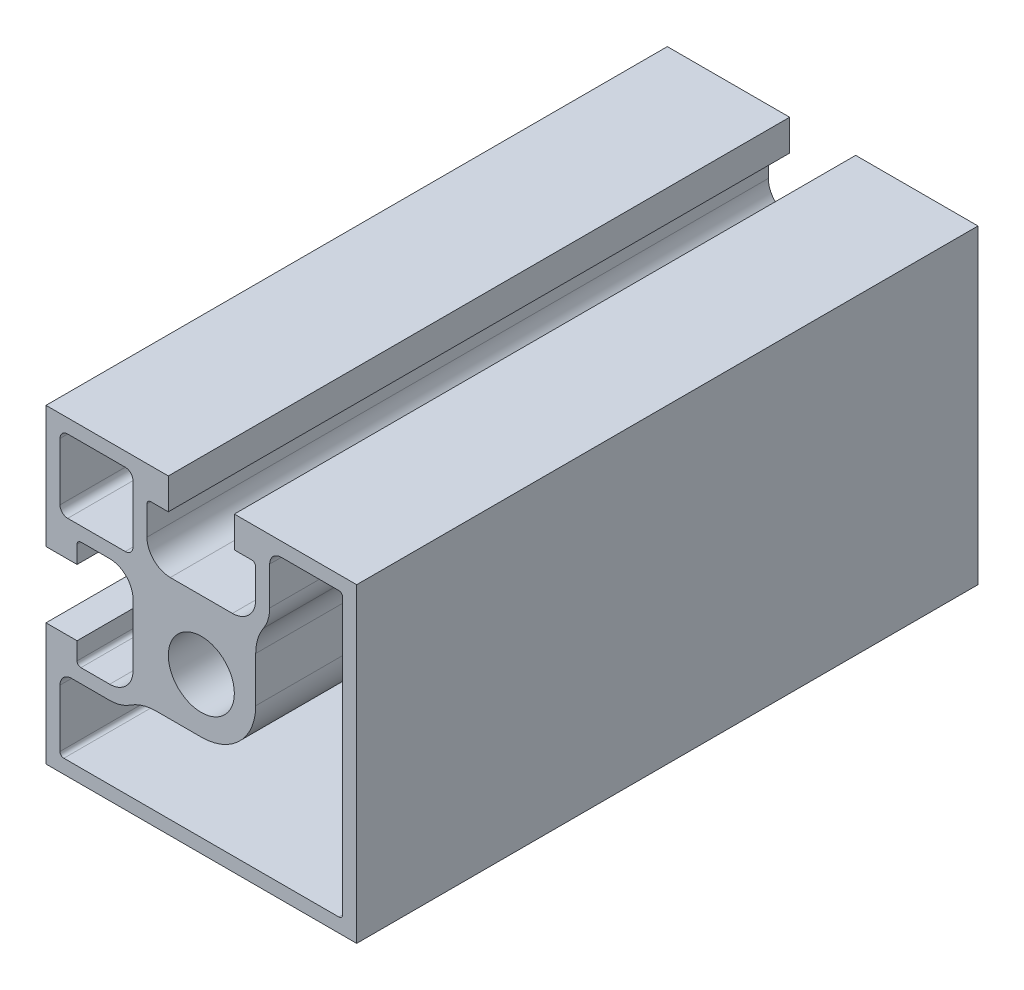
ISO-10303-21;
HEADER;
FILE_DESCRIPTION(('STEP AP214'),'2;1');
FILE_NAME('part.step','',(''),(''),'','','');
FILE_SCHEMA(('AUTOMOTIVE_DESIGN { 1 0 10303 214 1 1 1 1 }'));
ENDSEC;
DATA;
#1=APPLICATION_CONTEXT('core data for automotive mechanical design processes');
#2=APPLICATION_PROTOCOL_DEFINITION('international standard','automotive_design',2000,#1);
#3=PRODUCT_CONTEXT('',#1,'mechanical');
#4=PRODUCT('Part','Part','',(#3));
#5=PRODUCT_RELATED_PRODUCT_CATEGORY('part','',(#4));
#6=PRODUCT_DEFINITION_FORMATION('','',#4);
#7=PRODUCT_DEFINITION_CONTEXT('part definition',#1,'design');
#8=PRODUCT_DEFINITION('design','',#6,#7);
#9=PRODUCT_DEFINITION_SHAPE('','',#8);
#10=(LENGTH_UNIT() NAMED_UNIT(*) SI_UNIT(.MILLI.,.METRE.));
#11=(NAMED_UNIT(*) PLANE_ANGLE_UNIT() SI_UNIT($,.RADIAN.));
#12=(NAMED_UNIT(*) SI_UNIT($,.STERADIAN.) SOLID_ANGLE_UNIT());
#13=UNCERTAINTY_MEASURE_WITH_UNIT(LENGTH_MEASURE(1.E-05),#10,'distance_accuracy_value','');
#14=(GEOMETRIC_REPRESENTATION_CONTEXT(3) GLOBAL_UNCERTAINTY_ASSIGNED_CONTEXT((#13)) GLOBAL_UNIT_ASSIGNED_CONTEXT((#10,
#11,#12)) REPRESENTATION_CONTEXT('',''));
#15=CARTESIAN_POINT('',(0.,0.,0.));
#16=DIRECTION('',(0.,0.,1.));
#17=DIRECTION('',(1.,0.,0.));
#18=AXIS2_PLACEMENT_3D('',#15,#16,#17);
#19=CARTESIAN_POINT('',(0.,-18.2,40.));
#20=DIRECTION('',(0.,-1.,0.));
#21=DIRECTION('',(1.,0.,0.));
#22=AXIS2_PLACEMENT_3D('',#19,#20,#21);
#23=PLANE('',#22);
#24=DIRECTION('',(-1.,0.,0.));
#25=VECTOR('',#24,1.);
#26=CARTESIAN_POINT('',(0.,-18.2,-40.));
#27=LINE('',#26,#25);
#28=CARTESIAN_POINT('',(17.7,-18.2,-40.));
#29=VERTEX_POINT('',#28);
#30=CARTESIAN_POINT('',(-17.7,-18.2,-40.));
#31=VERTEX_POINT('',#30);
#32=EDGE_CURVE('E524',#29,#31,#27,.T.);
#33=ORIENTED_EDGE('',*,*,#32,.T.);
#34=DIRECTION('',(0.,0.,-1.));
#35=VECTOR('',#34,1.);
#36=CARTESIAN_POINT('',(-17.7,-18.2,40.));
#37=LINE('',#36,#35);
#38=CARTESIAN_POINT('',(-17.7,-18.2,40.));
#39=VERTEX_POINT('',#38);
#40=EDGE_CURVE('E11',#39,#31,#37,.T.);
#41=ORIENTED_EDGE('',*,*,#40,.F.);
#42=DIRECTION('',(-1.,0.,0.));
#43=VECTOR('',#42,1.);
#44=CARTESIAN_POINT('',(0.,-18.2,40.));
#45=LINE('',#44,#43);
#46=CARTESIAN_POINT('',(17.7,-18.2,40.));
#47=VERTEX_POINT('',#46);
#48=EDGE_CURVE('E1312',#47,#39,#45,.T.);
#49=ORIENTED_EDGE('',*,*,#48,.F.);
#50=DIRECTION('',(0.,0.,-1.));
#51=VECTOR('',#50,1.);
#52=CARTESIAN_POINT('',(17.7,-18.2,40.));
#53=LINE('',#52,#51);
#54=EDGE_CURVE('E567',#47,#29,#53,.T.);
#55=ORIENTED_EDGE('',*,*,#54,.T.);
#56=EDGE_LOOP('',(#33,#41,#49,#55));
#57=FACE_BOUND('',#56,.T.);
#58=ADVANCED_FACE('F37',(#57),#23,.F.);
#59=CARTESIAN_POINT('',(-17.7,-17.7,40.));
#60=DIRECTION('',(0.,0.,-1.));
#61=DIRECTION('',(-1.,0.,0.));
#62=AXIS2_PLACEMENT_3D('',#59,#60,#61);
#63=CYLINDRICAL_SURFACE('',#62,0.5);
#64=CARTESIAN_POINT('',(-17.7,-17.7,-40.));
#65=DIRECTION('',(0.,0.,1.));
#66=DIRECTION('',(1.,0.,0.));
#67=AXIS2_PLACEMENT_3D('',#64,#65,#66);
#68=CIRCLE('',#67,0.5);
#69=CARTESIAN_POINT('',(-18.2,-17.7,-40.));
#70=VERTEX_POINT('',#69);
#71=EDGE_CURVE('E527',#31,#70,#68,.F.);
#72=ORIENTED_EDGE('',*,*,#71,.T.);
#73=DIRECTION('',(0.,0.,-1.));
#74=VECTOR('',#73,1.);
#75=CARTESIAN_POINT('',(-18.2,-17.7,40.));
#76=LINE('',#75,#74);
#77=CARTESIAN_POINT('',(-18.2,-17.7,40.));
#78=VERTEX_POINT('',#77);
#79=EDGE_CURVE('E47',#78,#70,#76,.T.);
#80=ORIENTED_EDGE('',*,*,#79,.F.);
#81=CARTESIAN_POINT('',(-17.7,-17.7,40.));
#82=DIRECTION('',(0.,0.,1.));
#83=DIRECTION('',(1.,0.,0.));
#84=AXIS2_PLACEMENT_3D('',#81,#82,#83);
#85=CIRCLE('',#84,0.5);
#86=EDGE_CURVE('E1313',#39,#78,#85,.F.);
#87=ORIENTED_EDGE('',*,*,#86,.F.);
#88=ORIENTED_EDGE('',*,*,#40,.T.);
#89=EDGE_LOOP('',(#72,#80,#87,#88));
#90=FACE_BOUND('',#89,.T.);
#91=ADVANCED_FACE('F727',(#90),#63,.F.);
#92=CARTESIAN_POINT('',(-18.2,0.,40.));
#93=DIRECTION('',(-1.,0.,0.));
#94=DIRECTION('',(0.,0.,1.));
#95=AXIS2_PLACEMENT_3D('',#92,#93,#94);
#96=PLANE('',#95);
#97=DIRECTION('',(0.,1.,0.));
#98=VECTOR('',#97,1.);
#99=CARTESIAN_POINT('',(-18.2,0.,-40.));
#100=LINE('',#99,#98);
#101=CARTESIAN_POINT('',(-18.2,-10.3,-40.));
#102=VERTEX_POINT('',#101);
#103=EDGE_CURVE('E529',#70,#102,#100,.T.);
#104=ORIENTED_EDGE('',*,*,#103,.T.);
#105=DIRECTION('',(0.,0.,-1.));
#106=VECTOR('',#105,1.);
#107=CARTESIAN_POINT('',(-18.2,-10.3,40.));
#108=LINE('',#107,#106);
#109=CARTESIAN_POINT('',(-18.2,-10.3,40.));
#110=VERTEX_POINT('',#109);
#111=EDGE_CURVE('E597',#110,#102,#108,.T.);
#112=ORIENTED_EDGE('',*,*,#111,.F.);
#113=DIRECTION('',(0.,1.,0.));
#114=VECTOR('',#113,1.);
#115=CARTESIAN_POINT('',(-18.2,0.,40.));
#116=LINE('',#115,#114);
#117=EDGE_CURVE('E1283',#78,#110,#116,.T.);
#118=ORIENTED_EDGE('',*,*,#117,.F.);
#119=ORIENTED_EDGE('',*,*,#79,.T.);
#120=EDGE_LOOP('',(#104,#112,#118,#119));
#121=FACE_BOUND('',#120,.T.);
#122=ADVANCED_FACE('F733',(#121),#96,.F.);
#123=CARTESIAN_POINT('',(-16.7,-10.3,40.));
#124=DIRECTION('',(0.,0.,-1.));
#125=DIRECTION('',(-1.,0.,0.));
#126=AXIS2_PLACEMENT_3D('',#123,#124,#125);
#127=CYLINDRICAL_SURFACE('',#126,1.5);
#128=CARTESIAN_POINT('',(-16.7,-10.3,-40.));
#129=DIRECTION('',(0.,0.,1.));
#130=DIRECTION('',(1.,0.,0.));
#131=AXIS2_PLACEMENT_3D('',#128,#129,#130);
#132=CIRCLE('',#131,1.5);
#133=CARTESIAN_POINT('',(-16.7,-8.8,-40.));
#134=VERTEX_POINT('',#133);
#135=EDGE_CURVE('E531',#102,#134,#132,.F.);
#136=ORIENTED_EDGE('',*,*,#135,.T.);
#137=DIRECTION('',(0.,0.,-1.));
#138=VECTOR('',#137,1.);
#139=CARTESIAN_POINT('',(-16.7,-8.8,40.));
#140=LINE('',#139,#138);
#141=CARTESIAN_POINT('',(-16.7,-8.8,40.));
#142=VERTEX_POINT('',#141);
#143=EDGE_CURVE('E595',#142,#134,#140,.T.);
#144=ORIENTED_EDGE('',*,*,#143,.F.);
#145=CARTESIAN_POINT('',(-16.7,-10.3,40.));
#146=DIRECTION('',(0.,0.,1.));
#147=DIRECTION('',(1.,0.,0.));
#148=AXIS2_PLACEMENT_3D('',#145,#146,#147);
#149=CIRCLE('',#148,1.5);
#150=EDGE_CURVE('E1269',#110,#142,#149,.F.);
#151=ORIENTED_EDGE('',*,*,#150,.F.);
#152=ORIENTED_EDGE('',*,*,#111,.T.);
#153=EDGE_LOOP('',(#136,#144,#151,#152));
#154=FACE_BOUND('',#153,.T.);
#155=ADVANCED_FACE('F1189',(#154),#127,.F.);
#156=CARTESIAN_POINT('',(0.,-8.80000000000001,40.));
#157=DIRECTION('',(0.,-1.,0.));
#158=DIRECTION('',(1.,0.,0.));
#159=AXIS2_PLACEMENT_3D('',#156,#157,#158);
#160=PLANE('',#159);
#161=DIRECTION('',(-1.,0.,0.));
#162=VECTOR('',#161,1.);
#163=CARTESIAN_POINT('',(0.,-8.80000000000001,-40.));
#164=LINE('',#163,#162);
#165=CARTESIAN_POINT('',(-11.8,-8.8,-40.));
#166=VERTEX_POINT('',#165);
#167=EDGE_CURVE('E534',#166,#134,#164,.T.);
#168=ORIENTED_EDGE('',*,*,#167,.F.);
#169=DIRECTION('',(0.,0.,-1.));
#170=VECTOR('',#169,1.);
#171=CARTESIAN_POINT('',(-11.8,-8.8,40.));
#172=LINE('',#171,#170);
#173=CARTESIAN_POINT('',(-11.8,-8.8,40.));
#174=VERTEX_POINT('',#173);
#175=EDGE_CURVE('E593',#174,#166,#172,.T.);
#176=ORIENTED_EDGE('',*,*,#175,.F.);
#177=DIRECTION('',(-1.,0.,0.));
#178=VECTOR('',#177,1.);
#179=CARTESIAN_POINT('',(0.,-8.80000000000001,40.));
#180=LINE('',#179,#178);
#181=EDGE_CURVE('E1276',#174,#142,#180,.T.);
#182=ORIENTED_EDGE('',*,*,#181,.T.);
#183=ORIENTED_EDGE('',*,*,#143,.T.);
#184=EDGE_LOOP('',(#168,#176,#182,#183));
#185=FACE_BOUND('',#184,.T.);
#186=ADVANCED_FACE('F1180',(#185),#160,.T.);
#187=CARTESIAN_POINT('',(-11.8,-4.,40.));
#188=DIRECTION('',(0.,0.,-1.));
#189=DIRECTION('',(-1.,0.,0.));
#190=AXIS2_PLACEMENT_3D('',#187,#188,#189);
#191=CYLINDRICAL_SURFACE('',#190,4.8);
#192=CARTESIAN_POINT('',(-11.8,-4.,-40.));
#193=DIRECTION('',(0.,0.,1.));
#194=DIRECTION('',(1.,0.,0.));
#195=AXIS2_PLACEMENT_3D('',#192,#193,#194);
#196=CIRCLE('',#195,4.8);
#197=CARTESIAN_POINT('',(-9.14670016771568,-8.,-40.));
#198=VERTEX_POINT('',#197);
#199=EDGE_CURVE('E537',#198,#166,#196,.F.);
#200=ORIENTED_EDGE('',*,*,#199,.F.);
#201=DIRECTION('',(0.,0.,-1.));
#202=VECTOR('',#201,1.);
#203=CARTESIAN_POINT('',(-9.14670016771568,-8.,40.));
#204=LINE('',#203,#202);
#205=CARTESIAN_POINT('',(-9.14670016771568,-8.,40.));
#206=VERTEX_POINT('',#205);
#207=EDGE_CURVE('E591',#206,#198,#204,.T.);
#208=ORIENTED_EDGE('',*,*,#207,.F.);
#209=CARTESIAN_POINT('',(-11.8,-4.,40.));
#210=DIRECTION('',(0.,0.,1.));
#211=DIRECTION('',(1.,0.,0.));
#212=AXIS2_PLACEMENT_3D('',#209,#210,#211);
#213=CIRCLE('',#212,4.8);
#214=EDGE_CURVE('E1279',#206,#174,#213,.F.);
#215=ORIENTED_EDGE('',*,*,#214,.T.);
#216=ORIENTED_EDGE('',*,*,#175,.T.);
#217=EDGE_LOOP('',(#200,#208,#215,#216));
#218=FACE_BOUND('',#217,.T.);
#219=ADVANCED_FACE('F1171',(#218),#191,.T.);
#220=CARTESIAN_POINT('',(-5.83007537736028,-13.,40.));
#221=DIRECTION('',(0.,0.,-1.));
#222=DIRECTION('',(-1.,0.,0.));
#223=AXIS2_PLACEMENT_3D('',#220,#221,#222);
#224=CYLINDRICAL_SURFACE('',#223,6.);
#225=CARTESIAN_POINT('',(-5.83007537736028,-13.,-40.));
#226=DIRECTION('',(0.,0.,1.));
#227=DIRECTION('',(1.,0.,0.));
#228=AXIS2_PLACEMENT_3D('',#225,#226,#227);
#229=CIRCLE('',#228,6.);
#230=CARTESIAN_POINT('',(-5.83007537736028,-7.,-40.));
#231=VERTEX_POINT('',#230);
#232=EDGE_CURVE('E540',#198,#231,#229,.F.);
#233=ORIENTED_EDGE('',*,*,#232,.T.);
#234=DIRECTION('',(0.,0.,-1.));
#235=VECTOR('',#234,1.);
#236=CARTESIAN_POINT('',(-5.83007537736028,-7.,40.));
#237=LINE('',#236,#235);
#238=CARTESIAN_POINT('',(-5.83007537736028,-7.,40.));
#239=VERTEX_POINT('',#238);
#240=EDGE_CURVE('E589',#239,#231,#237,.T.);
#241=ORIENTED_EDGE('',*,*,#240,.F.);
#242=CARTESIAN_POINT('',(-5.83007537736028,-13.,40.));
#243=DIRECTION('',(0.,0.,1.));
#244=DIRECTION('',(1.,0.,0.));
#245=AXIS2_PLACEMENT_3D('',#242,#243,#244);
#246=CIRCLE('',#245,6.);
#247=EDGE_CURVE('E1281',#206,#239,#246,.F.);
#248=ORIENTED_EDGE('',*,*,#247,.F.);
#249=ORIENTED_EDGE('',*,*,#207,.T.);
#250=EDGE_LOOP('',(#233,#241,#248,#249));
#251=FACE_BOUND('',#250,.T.);
#252=ADVANCED_FACE('F1162',(#251),#224,.F.);
#253=CARTESIAN_POINT('',(0.,-7.,40.));
#254=DIRECTION('',(0.,-1.,0.));
#255=DIRECTION('',(1.,0.,0.));
#256=AXIS2_PLACEMENT_3D('',#253,#254,#255);
#257=PLANE('',#256);
#258=DIRECTION('',(-1.,0.,0.));
#259=VECTOR('',#258,1.);
#260=CARTESIAN_POINT('',(0.,-7.,-40.));
#261=LINE('',#260,#259);
#262=CARTESIAN_POINT('',(0.,-7.,-40.));
#263=VERTEX_POINT('',#262);
#264=EDGE_CURVE('E543',#263,#231,#261,.T.);
#265=ORIENTED_EDGE('',*,*,#264,.F.);
#266=DIRECTION('',(0.,0.,-1.));
#267=VECTOR('',#266,1.);
#268=CARTESIAN_POINT('',(0.,-7.,40.));
#269=LINE('',#268,#267);
#270=CARTESIAN_POINT('',(0.,-7.,40.));
#271=VERTEX_POINT('',#270);
#272=EDGE_CURVE('E587',#271,#263,#269,.T.);
#273=ORIENTED_EDGE('',*,*,#272,.F.);
#274=DIRECTION('',(-1.,0.,0.));
#275=VECTOR('',#274,1.);
#276=CARTESIAN_POINT('',(0.,-7.,40.));
#277=LINE('',#276,#275);
#278=EDGE_CURVE('E1288',#271,#239,#277,.T.);
#279=ORIENTED_EDGE('',*,*,#278,.T.);
#280=ORIENTED_EDGE('',*,*,#240,.T.);
#281=EDGE_LOOP('',(#265,#273,#279,#280));
#282=FACE_BOUND('',#281,.T.);
#283=ADVANCED_FACE('F1153',(#282),#257,.T.);
#284=CARTESIAN_POINT('',(0.,0.,40.));
#285=DIRECTION('',(0.,0.,-1.));
#286=DIRECTION('',(-1.,0.,0.));
#287=AXIS2_PLACEMENT_3D('',#284,#285,#286);
#288=CYLINDRICAL_SURFACE('',#287,7.);
#289=CARTESIAN_POINT('',(0.,0.,-40.));
#290=DIRECTION('',(0.,0.,1.));
#291=DIRECTION('',(1.,0.,0.));
#292=AXIS2_PLACEMENT_3D('',#289,#290,#291);
#293=CIRCLE('',#292,7.);
#294=CARTESIAN_POINT('',(7.,0.,-40.));
#295=VERTEX_POINT('',#294);
#296=EDGE_CURVE('E546',#263,#295,#293,.T.);
#297=ORIENTED_EDGE('',*,*,#296,.T.);
#298=DIRECTION('',(0.,0.,-1.));
#299=VECTOR('',#298,1.);
#300=CARTESIAN_POINT('',(7.,0.,40.));
#301=LINE('',#300,#299);
#302=CARTESIAN_POINT('',(7.,0.,40.));
#303=VERTEX_POINT('',#302);
#304=EDGE_CURVE('E584',#303,#295,#301,.T.);
#305=ORIENTED_EDGE('',*,*,#304,.F.);
#306=CARTESIAN_POINT('',(0.,0.,40.));
#307=DIRECTION('',(0.,0.,1.));
#308=DIRECTION('',(1.,0.,0.));
#309=AXIS2_PLACEMENT_3D('',#306,#307,#308);
#310=CIRCLE('',#309,7.);
#311=EDGE_CURVE('E1291',#271,#303,#310,.T.);
#312=ORIENTED_EDGE('',*,*,#311,.F.);
#313=ORIENTED_EDGE('',*,*,#272,.T.);
#314=EDGE_LOOP('',(#297,#305,#312,#313));
#315=FACE_BOUND('',#314,.T.);
#316=ADVANCED_FACE('F1144',(#315),#288,.T.);
#317=CARTESIAN_POINT('',(7.,0.,40.));
#318=DIRECTION('',(-1.,0.,0.));
#319=DIRECTION('',(0.,-1.,0.));
#320=AXIS2_PLACEMENT_3D('',#317,#318,#319);
#321=PLANE('',#320);
#322=DIRECTION('',(0.,1.,0.));
#323=VECTOR('',#322,1.);
#324=CARTESIAN_POINT('',(7.,0.,-40.));
#325=LINE('',#324,#323);
#326=CARTESIAN_POINT('',(7.,5.83007537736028,-40.));
#327=VERTEX_POINT('',#326);
#328=EDGE_CURVE('E548',#295,#327,#325,.T.);
#329=ORIENTED_EDGE('',*,*,#328,.T.);
#330=DIRECTION('',(0.,0.,-1.));
#331=VECTOR('',#330,1.);
#332=CARTESIAN_POINT('',(7.,5.83007537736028,40.));
#333=LINE('',#332,#331);
#334=CARTESIAN_POINT('',(7.,5.83007537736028,40.));
#335=VERTEX_POINT('',#334);
#336=EDGE_CURVE('E581',#335,#327,#333,.T.);
#337=ORIENTED_EDGE('',*,*,#336,.F.);
#338=DIRECTION('',(0.,1.,0.));
#339=VECTOR('',#338,1.);
#340=CARTESIAN_POINT('',(7.,0.,40.));
#341=LINE('',#340,#339);
#342=EDGE_CURVE('E1293',#303,#335,#341,.T.);
#343=ORIENTED_EDGE('',*,*,#342,.F.);
#344=ORIENTED_EDGE('',*,*,#304,.T.);
#345=EDGE_LOOP('',(#329,#337,#343,#344));
#346=FACE_BOUND('',#345,.T.);
#347=ADVANCED_FACE('F1135',(#346),#321,.F.);
#348=CARTESIAN_POINT('',(13.,5.83007537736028,40.));
#349=DIRECTION('',(0.,0.,-1.));
#350=DIRECTION('',(-1.,0.,0.));
#351=AXIS2_PLACEMENT_3D('',#348,#349,#350);
#352=CYLINDRICAL_SURFACE('',#351,6.);
#353=CARTESIAN_POINT('',(13.,5.83007537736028,-40.));
#354=DIRECTION('',(0.,0.,1.));
#355=DIRECTION('',(1.,0.,0.));
#356=AXIS2_PLACEMENT_3D('',#353,#354,#355);
#357=CIRCLE('',#356,6.);
#358=CARTESIAN_POINT('',(8.,9.14670016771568,-40.));
#359=VERTEX_POINT('',#358);
#360=EDGE_CURVE('E550',#327,#359,#357,.F.);
#361=ORIENTED_EDGE('',*,*,#360,.T.);
#362=DIRECTION('',(0.,0.,-1.));
#363=VECTOR('',#362,1.);
#364=CARTESIAN_POINT('',(8.,9.14670016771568,40.));
#365=LINE('',#364,#363);
#366=CARTESIAN_POINT('',(8.,9.14670016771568,40.));
#367=VERTEX_POINT('',#366);
#368=EDGE_CURVE('E579',#367,#359,#365,.T.);
#369=ORIENTED_EDGE('',*,*,#368,.F.);
#370=CARTESIAN_POINT('',(13.,5.83007537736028,40.));
#371=DIRECTION('',(0.,0.,1.));
#372=DIRECTION('',(1.,0.,0.));
#373=AXIS2_PLACEMENT_3D('',#370,#371,#372);
#374=CIRCLE('',#373,6.);
#375=EDGE_CURVE('E1295',#335,#367,#374,.F.);
#376=ORIENTED_EDGE('',*,*,#375,.F.);
#377=ORIENTED_EDGE('',*,*,#336,.T.);
#378=EDGE_LOOP('',(#361,#369,#376,#377));
#379=FACE_BOUND('',#378,.T.);
#380=ADVANCED_FACE('F1126',(#379),#352,.F.);
#381=CARTESIAN_POINT('',(4.00000000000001,11.8,40.));
#382=DIRECTION('',(0.,0.,-1.));
#383=DIRECTION('',(-1.,0.,0.));
#384=AXIS2_PLACEMENT_3D('',#381,#382,#383);
#385=CYLINDRICAL_SURFACE('',#384,4.8);
#386=CARTESIAN_POINT('',(4.00000000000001,11.8,-40.));
#387=DIRECTION('',(0.,0.,1.));
#388=DIRECTION('',(1.,0.,0.));
#389=AXIS2_PLACEMENT_3D('',#386,#387,#388);
#390=CIRCLE('',#389,4.8);
#391=CARTESIAN_POINT('',(8.8,11.8,-40.));
#392=VERTEX_POINT('',#391);
#393=EDGE_CURVE('E553',#392,#359,#390,.F.);
#394=ORIENTED_EDGE('',*,*,#393,.F.);
#395=DIRECTION('',(0.,0.,-1.));
#396=VECTOR('',#395,1.);
#397=CARTESIAN_POINT('',(8.8,11.8,40.));
#398=LINE('',#397,#396);
#399=CARTESIAN_POINT('',(8.8,11.8,40.));
#400=VERTEX_POINT('',#399);
#401=EDGE_CURVE('E577',#400,#392,#398,.T.);
#402=ORIENTED_EDGE('',*,*,#401,.F.);
#403=CARTESIAN_POINT('',(4.00000000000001,11.8,40.));
#404=DIRECTION('',(0.,0.,1.));
#405=DIRECTION('',(1.,0.,0.));
#406=AXIS2_PLACEMENT_3D('',#403,#404,#405);
#407=CIRCLE('',#406,4.8);
#408=EDGE_CURVE('E1297',#400,#367,#407,.F.);
#409=ORIENTED_EDGE('',*,*,#408,.T.);
#410=ORIENTED_EDGE('',*,*,#368,.T.);
#411=EDGE_LOOP('',(#394,#402,#409,#410));
#412=FACE_BOUND('',#411,.T.);
#413=ADVANCED_FACE('F1117',(#412),#385,.T.);
#414=CARTESIAN_POINT('',(8.8,0.,40.));
#415=DIRECTION('',(1.,0.,0.));
#416=DIRECTION('',(0.,0.,-1.));
#417=AXIS2_PLACEMENT_3D('',#414,#415,#416);
#418=PLANE('',#417);
#419=DIRECTION('',(0.,-1.,0.));
#420=VECTOR('',#419,1.);
#421=CARTESIAN_POINT('',(8.8,0.,-40.));
#422=LINE('',#421,#420);
#423=CARTESIAN_POINT('',(8.8,16.7,-40.));
#424=VERTEX_POINT('',#423);
#425=EDGE_CURVE('E556',#424,#392,#422,.T.);
#426=ORIENTED_EDGE('',*,*,#425,.F.);
#427=DIRECTION('',(0.,0.,-1.));
#428=VECTOR('',#427,1.);
#429=CARTESIAN_POINT('',(8.8,16.7,40.));
#430=LINE('',#429,#428);
#431=CARTESIAN_POINT('',(8.8,16.7,40.));
#432=VERTEX_POINT('',#431);
#433=EDGE_CURVE('E575',#432,#424,#430,.T.);
#434=ORIENTED_EDGE('',*,*,#433,.F.);
#435=DIRECTION('',(0.,-1.,0.));
#436=VECTOR('',#435,1.);
#437=CARTESIAN_POINT('',(8.8,0.,40.));
#438=LINE('',#437,#436);
#439=EDGE_CURVE('E1300',#432,#400,#438,.T.);
#440=ORIENTED_EDGE('',*,*,#439,.T.);
#441=ORIENTED_EDGE('',*,*,#401,.T.);
#442=EDGE_LOOP('',(#426,#434,#440,#441));
#443=FACE_BOUND('',#442,.T.);
#444=ADVANCED_FACE('F1108',(#443),#418,.T.);
#445=CARTESIAN_POINT('',(10.3,16.7,40.));
#446=DIRECTION('',(0.,0.,-1.));
#447=DIRECTION('',(-1.,0.,0.));
#448=AXIS2_PLACEMENT_3D('',#445,#446,#447);
#449=CYLINDRICAL_SURFACE('',#448,1.5);
#450=CARTESIAN_POINT('',(10.3,16.7,-40.));
#451=DIRECTION('',(0.,0.,1.));
#452=DIRECTION('',(1.,0.,0.));
#453=AXIS2_PLACEMENT_3D('',#450,#451,#452);
#454=CIRCLE('',#453,1.5);
#455=CARTESIAN_POINT('',(10.3,18.2,-40.));
#456=VERTEX_POINT('',#455);
#457=EDGE_CURVE('E559',#424,#456,#454,.F.);
#458=ORIENTED_EDGE('',*,*,#457,.T.);
#459=DIRECTION('',(0.,0.,-1.));
#460=VECTOR('',#459,1.);
#461=CARTESIAN_POINT('',(10.3,18.2,40.));
#462=LINE('',#461,#460);
#463=CARTESIAN_POINT('',(10.3,18.2,40.));
#464=VERTEX_POINT('',#463);
#465=EDGE_CURVE('E572',#464,#456,#462,.T.);
#466=ORIENTED_EDGE('',*,*,#465,.F.);
#467=CARTESIAN_POINT('',(10.3,16.7,40.));
#468=DIRECTION('',(0.,0.,1.));
#469=DIRECTION('',(1.,0.,0.));
#470=AXIS2_PLACEMENT_3D('',#467,#468,#469);
#471=CIRCLE('',#470,1.5);
#472=EDGE_CURVE('E1303',#432,#464,#471,.F.);
#473=ORIENTED_EDGE('',*,*,#472,.F.);
#474=ORIENTED_EDGE('',*,*,#433,.T.);
#475=EDGE_LOOP('',(#458,#466,#473,#474));
#476=FACE_BOUND('',#475,.T.);
#477=ADVANCED_FACE('F1099',(#476),#449,.F.);
#478=CARTESIAN_POINT('',(0.,18.2,40.));
#479=DIRECTION('',(0.,1.,0.));
#480=DIRECTION('',(0.,0.,1.));
#481=AXIS2_PLACEMENT_3D('',#478,#479,#480);
#482=PLANE('',#481);
#483=DIRECTION('',(1.,0.,0.));
#484=VECTOR('',#483,1.);
#485=CARTESIAN_POINT('',(0.,18.2,-40.));
#486=LINE('',#485,#484);
#487=CARTESIAN_POINT('',(17.7,18.2,-40.));
#488=VERTEX_POINT('',#487);
#489=EDGE_CURVE('E561',#456,#488,#486,.T.);
#490=ORIENTED_EDGE('',*,*,#489,.T.);
#491=DIRECTION('',(0.,0.,-1.));
#492=VECTOR('',#491,1.);
#493=CARTESIAN_POINT('',(17.7,18.2,40.));
#494=LINE('',#493,#492);
#495=CARTESIAN_POINT('',(17.7,18.2,40.));
#496=VERTEX_POINT('',#495);
#497=EDGE_CURVE('E404',#496,#488,#494,.T.);
#498=ORIENTED_EDGE('',*,*,#497,.F.);
#499=DIRECTION('',(1.,0.,0.));
#500=VECTOR('',#499,1.);
#501=CARTESIAN_POINT('',(0.,18.2,40.));
#502=LINE('',#501,#500);
#503=EDGE_CURVE('E395',#464,#496,#502,.T.);
#504=ORIENTED_EDGE('',*,*,#503,.F.);
#505=ORIENTED_EDGE('',*,*,#465,.T.);
#506=EDGE_LOOP('',(#490,#498,#504,#505));
#507=FACE_BOUND('',#506,.T.);
#508=ADVANCED_FACE('F1091',(#507),#482,.F.);
#509=CARTESIAN_POINT('',(17.7,17.7,40.));
#510=DIRECTION('',(0.,0.,-1.));
#511=DIRECTION('',(-1.,0.,0.));
#512=AXIS2_PLACEMENT_3D('',#509,#510,#511);
#513=CYLINDRICAL_SURFACE('',#512,0.5);
#514=CARTESIAN_POINT('',(17.7,17.7,-40.));
#515=DIRECTION('',(0.,0.,1.));
#516=DIRECTION('',(1.,0.,0.));
#517=AXIS2_PLACEMENT_3D('',#514,#515,#516);
#518=CIRCLE('',#517,0.5);
#519=CARTESIAN_POINT('',(18.2,17.7,-40.));
#520=VERTEX_POINT('',#519);
#521=EDGE_CURVE('E403',#488,#520,#518,.F.);
#522=ORIENTED_EDGE('',*,*,#521,.T.);
#523=DIRECTION('',(0.,0.,-1.));
#524=VECTOR('',#523,1.);
#525=CARTESIAN_POINT('',(18.2,17.7,40.));
#526=LINE('',#525,#524);
#527=CARTESIAN_POINT('',(18.2,17.7,40.));
#528=VERTEX_POINT('',#527);
#529=EDGE_CURVE('E400',#528,#520,#526,.T.);
#530=ORIENTED_EDGE('',*,*,#529,.F.);
#531=CARTESIAN_POINT('',(17.7,17.7,40.));
#532=DIRECTION('',(0.,0.,1.));
#533=DIRECTION('',(1.,0.,0.));
#534=AXIS2_PLACEMENT_3D('',#531,#532,#533);
#535=CIRCLE('',#534,0.5);
#536=EDGE_CURVE('E389',#496,#528,#535,.F.);
#537=ORIENTED_EDGE('',*,*,#536,.F.);
#538=ORIENTED_EDGE('',*,*,#497,.T.);
#539=EDGE_LOOP('',(#522,#530,#537,#538));
#540=FACE_BOUND('',#539,.T.);
#541=ADVANCED_FACE('F401',(#540),#513,.F.);
#542=CARTESIAN_POINT('',(18.2,0.,40.));
#543=DIRECTION('',(1.,0.,0.));
#544=DIRECTION('',(0.,1.,0.));
#545=AXIS2_PLACEMENT_3D('',#542,#543,#544);
#546=PLANE('',#545);
#547=DIRECTION('',(0.,-1.,0.));
#548=VECTOR('',#547,1.);
#549=CARTESIAN_POINT('',(18.2,0.,-40.));
#550=LINE('',#549,#548);
#551=CARTESIAN_POINT('',(18.2,-17.7,-40.));
#552=VERTEX_POINT('',#551);
#553=EDGE_CURVE('E223',#520,#552,#550,.T.);
#554=ORIENTED_EDGE('',*,*,#553,.T.);
#555=DIRECTION('',(0.,0.,-1.));
#556=VECTOR('',#555,1.);
#557=CARTESIAN_POINT('',(18.2,-17.7,40.));
#558=LINE('',#557,#556);
#559=CARTESIAN_POINT('',(18.2,-17.7,40.));
#560=VERTEX_POINT('',#559);
#561=EDGE_CURVE('E405',#560,#552,#558,.T.);
#562=ORIENTED_EDGE('',*,*,#561,.F.);
#563=DIRECTION('',(0.,-1.,0.));
#564=VECTOR('',#563,1.);
#565=CARTESIAN_POINT('',(18.2,0.,40.));
#566=LINE('',#565,#564);
#567=EDGE_CURVE('E393',#528,#560,#566,.T.);
#568=ORIENTED_EDGE('',*,*,#567,.F.);
#569=ORIENTED_EDGE('',*,*,#529,.T.);
#570=EDGE_LOOP('',(#554,#562,#568,#569));
#571=FACE_BOUND('',#570,.T.);
#572=ADVANCED_FACE('F407',(#571),#546,.F.);
#573=CARTESIAN_POINT('',(-6.5,15.5,40.));
#574=DIRECTION('',(0.,0.,-1.));
#575=DIRECTION('',(-1.,0.,0.));
#576=AXIS2_PLACEMENT_3D('',#573,#574,#575);
#577=CYLINDRICAL_SURFACE('',#576,0.5);
#578=CARTESIAN_POINT('',(-6.5,15.5,-40.));
#579=DIRECTION('',(0.,0.,1.));
#580=DIRECTION('',(1.,0.,0.));
#581=AXIS2_PLACEMENT_3D('',#578,#579,#580);
#582=CIRCLE('',#581,0.5);
#583=CARTESIAN_POINT('',(-6.5,16.,-40.));
#584=VERTEX_POINT('',#583);
#585=CARTESIAN_POINT('',(-7.,15.5,-40.));
#586=VERTEX_POINT('',#585);
#587=EDGE_CURVE('E440',#584,#586,#582,.T.);
#588=ORIENTED_EDGE('',*,*,#587,.F.);
#589=DIRECTION('',(0.,0.,-1.));
#590=VECTOR('',#589,1.);
#591=CARTESIAN_POINT('',(-6.5,16.,40.));
#592=LINE('',#591,#590);
#593=CARTESIAN_POINT('',(-6.5,16.,40.));
#594=VERTEX_POINT('',#593);
#595=EDGE_CURVE('E569',#594,#584,#592,.T.);
#596=ORIENTED_EDGE('',*,*,#595,.F.);
#597=CARTESIAN_POINT('',(-6.5,15.5,40.));
#598=DIRECTION('',(0.,0.,1.));
#599=DIRECTION('',(1.,0.,0.));
#600=AXIS2_PLACEMENT_3D('',#597,#598,#599);
#601=CIRCLE('',#600,0.5);
#602=CARTESIAN_POINT('',(-7.,15.5,40.));
#603=VERTEX_POINT('',#602);
#604=EDGE_CURVE('E1395',#594,#603,#601,.T.);
#605=ORIENTED_EDGE('',*,*,#604,.T.);
#606=DIRECTION('',(0.,0.,-1.));
#607=VECTOR('',#606,1.);
#608=CARTESIAN_POINT('',(-7.,15.5,40.));
#609=LINE('',#608,#607);
#610=EDGE_CURVE('E602',#603,#586,#609,.T.);
#611=ORIENTED_EDGE('',*,*,#610,.T.);
#612=EDGE_LOOP('',(#588,#596,#605,#611));
#613=FACE_BOUND('',#612,.T.);
#614=ADVANCED_FACE('F845',(#613),#577,.F.);
#615=CARTESIAN_POINT('',(0.,16.,40.));
#616=DIRECTION('',(0.,-1.,0.));
#617=DIRECTION('',(1.,0.,0.));
#618=AXIS2_PLACEMENT_3D('',#615,#616,#617);
#619=PLANE('',#618);
#620=DIRECTION('',(-1.,0.,0.));
#621=VECTOR('',#620,1.);
#622=CARTESIAN_POINT('',(0.,16.,-40.));
#623=LINE('',#622,#621);
#624=CARTESIAN_POINT('',(-4.25,16.,-40.));
#625=VERTEX_POINT('',#624);
#626=EDGE_CURVE('E443',#625,#584,#623,.T.);
#627=ORIENTED_EDGE('',*,*,#626,.F.);
#628=DIRECTION('',(0.,0.,-1.));
#629=VECTOR('',#628,1.);
#630=CARTESIAN_POINT('',(-4.25,16.,40.));
#631=LINE('',#630,#629);
#632=CARTESIAN_POINT('',(-4.25,16.,40.));
#633=VERTEX_POINT('',#632);
#634=EDGE_CURVE('E660',#633,#625,#631,.T.);
#635=ORIENTED_EDGE('',*,*,#634,.F.);
#636=DIRECTION('',(-1.,0.,0.));
#637=VECTOR('',#636,1.);
#638=CARTESIAN_POINT('',(0.,16.,40.));
#639=LINE('',#638,#637);
#640=EDGE_CURVE('E1392',#633,#594,#639,.T.);
#641=ORIENTED_EDGE('',*,*,#640,.T.);
#642=ORIENTED_EDGE('',*,*,#595,.T.);
#643=EDGE_LOOP('',(#627,#635,#641,#642));
#644=FACE_BOUND('',#643,.T.);
#645=ADVANCED_FACE('F841',(#644),#619,.T.);
#646=CARTESIAN_POINT('',(-4.24999999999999,0.,40.));
#647=DIRECTION('',(1.,0.,0.));
#648=DIRECTION('',(0.,1.,0.));
#649=AXIS2_PLACEMENT_3D('',#646,#647,#648);
#650=PLANE('',#649);
#651=DIRECTION('',(0.,-1.,0.));
#652=VECTOR('',#651,1.);
#653=CARTESIAN_POINT('',(-4.24999999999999,0.,-40.));
#654=LINE('',#653,#652);
#655=CARTESIAN_POINT('',(-4.25,20.,-40.));
#656=VERTEX_POINT('',#655);
#657=EDGE_CURVE('E446',#656,#625,#654,.T.);
#658=ORIENTED_EDGE('',*,*,#657,.F.);
#659=DIRECTION('',(0.,0.,-1.));
#660=VECTOR('',#659,1.);
#661=CARTESIAN_POINT('',(-4.25,20.,40.));
#662=LINE('',#661,#660);
#663=CARTESIAN_POINT('',(-4.25,20.,40.));
#664=VERTEX_POINT('',#663);
#665=EDGE_CURVE('E658',#664,#656,#662,.T.);
#666=ORIENTED_EDGE('',*,*,#665,.F.);
#667=DIRECTION('',(0.,-1.,0.));
#668=VECTOR('',#667,1.);
#669=CARTESIAN_POINT('',(-4.24999999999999,0.,40.));
#670=LINE('',#669,#668);
#671=EDGE_CURVE('E1389',#664,#633,#670,.T.);
#672=ORIENTED_EDGE('',*,*,#671,.T.);
#673=ORIENTED_EDGE('',*,*,#634,.T.);
#674=EDGE_LOOP('',(#658,#666,#672,#673));
#675=FACE_BOUND('',#674,.T.);
#676=ADVANCED_FACE('F837',(#675),#650,.T.);
#677=CARTESIAN_POINT('',(0.,20.,40.));
#678=DIRECTION('',(0.,1.,0.));
#679=DIRECTION('',(-1.,0.,0.));
#680=AXIS2_PLACEMENT_3D('',#677,#678,#679);
#681=PLANE('',#680);
#682=DIRECTION('',(1.,0.,0.));
#683=VECTOR('',#682,1.);
#684=CARTESIAN_POINT('',(0.,20.,-40.));
#685=LINE('',#684,#683);
#686=CARTESIAN_POINT('',(-20.,20.,-40.));
#687=VERTEX_POINT('',#686);
#688=EDGE_CURVE('E449',#687,#656,#685,.T.);
#689=ORIENTED_EDGE('',*,*,#688,.F.);
#690=DIRECTION('',(0.,0.,-1.));
#691=VECTOR('',#690,1.);
#692=CARTESIAN_POINT('',(-20.,20.,40.));
#693=LINE('',#692,#691);
#694=CARTESIAN_POINT('',(-20.,20.,40.));
#695=VERTEX_POINT('',#694);
#696=EDGE_CURVE('E656',#695,#687,#693,.T.);
#697=ORIENTED_EDGE('',*,*,#696,.F.);
#698=DIRECTION('',(1.,0.,0.));
#699=VECTOR('',#698,1.);
#700=CARTESIAN_POINT('',(0.,20.,40.));
#701=LINE('',#700,#699);
#702=EDGE_CURVE('E1386',#695,#664,#701,.T.);
#703=ORIENTED_EDGE('',*,*,#702,.T.);
#704=ORIENTED_EDGE('',*,*,#665,.T.);
#705=EDGE_LOOP('',(#689,#697,#703,#704));
#706=FACE_BOUND('',#705,.T.);
#707=ADVANCED_FACE('F833',(#706),#681,.T.);
#708=CARTESIAN_POINT('',(-20.,0.,40.));
#709=DIRECTION('',(-1.,0.,0.));
#710=DIRECTION('',(0.,0.,1.));
#711=AXIS2_PLACEMENT_3D('',#708,#709,#710);
#712=PLANE('',#711);
#713=DIRECTION('',(0.,1.,0.));
#714=VECTOR('',#713,1.);
#715=CARTESIAN_POINT('',(-20.,0.,-40.));
#716=LINE('',#715,#714);
#717=CARTESIAN_POINT('',(-20.,4.25,-40.));
#718=VERTEX_POINT('',#717);
#719=EDGE_CURVE('E452',#718,#687,#716,.T.);
#720=ORIENTED_EDGE('',*,*,#719,.F.);
#721=DIRECTION('',(0.,0.,-1.));
#722=VECTOR('',#721,1.);
#723=CARTESIAN_POINT('',(-20.,4.25,40.));
#724=LINE('',#723,#722);
#725=CARTESIAN_POINT('',(-20.,4.25,40.));
#726=VERTEX_POINT('',#725);
#727=EDGE_CURVE('E654',#726,#718,#724,.T.);
#728=ORIENTED_EDGE('',*,*,#727,.F.);
#729=DIRECTION('',(0.,1.,0.));
#730=VECTOR('',#729,1.);
#731=CARTESIAN_POINT('',(-20.,0.,40.));
#732=LINE('',#731,#730);
#733=EDGE_CURVE('E1383',#726,#695,#732,.T.);
#734=ORIENTED_EDGE('',*,*,#733,.T.);
#735=ORIENTED_EDGE('',*,*,#696,.T.);
#736=EDGE_LOOP('',(#720,#728,#734,#735));
#737=FACE_BOUND('',#736,.T.);
#738=ADVANCED_FACE('F829',(#737),#712,.T.);
#739=CARTESIAN_POINT('',(0.,4.25,40.));
#740=DIRECTION('',(0.,-1.,0.));
#741=DIRECTION('',(0.,0.,-1.));
#742=AXIS2_PLACEMENT_3D('',#739,#740,#741);
#743=PLANE('',#742);
#744=DIRECTION('',(-1.,0.,0.));
#745=VECTOR('',#744,1.);
#746=CARTESIAN_POINT('',(0.,4.25,-40.));
#747=LINE('',#746,#745);
#748=CARTESIAN_POINT('',(-16.,4.25,-40.));
#749=VERTEX_POINT('',#748);
#750=EDGE_CURVE('E455',#749,#718,#747,.T.);
#751=ORIENTED_EDGE('',*,*,#750,.F.);
#752=DIRECTION('',(0.,0.,-1.));
#753=VECTOR('',#752,1.);
#754=CARTESIAN_POINT('',(-16.,4.25,40.));
#755=LINE('',#754,#753);
#756=CARTESIAN_POINT('',(-16.,4.25,40.));
#757=VERTEX_POINT('',#756);
#758=EDGE_CURVE('E652',#757,#749,#755,.T.);
#759=ORIENTED_EDGE('',*,*,#758,.F.);
#760=DIRECTION('',(-1.,0.,0.));
#761=VECTOR('',#760,1.);
#762=CARTESIAN_POINT('',(0.,4.25,40.));
#763=LINE('',#762,#761);
#764=EDGE_CURVE('E1380',#757,#726,#763,.T.);
#765=ORIENTED_EDGE('',*,*,#764,.T.);
#766=ORIENTED_EDGE('',*,*,#727,.T.);
#767=EDGE_LOOP('',(#751,#759,#765,#766));
#768=FACE_BOUND('',#767,.T.);
#769=ADVANCED_FACE('F825',(#768),#743,.T.);
#770=CARTESIAN_POINT('',(-16.,0.,40.));
#771=DIRECTION('',(1.,0.,0.));
#772=DIRECTION('',(0.,0.,-1.));
#773=AXIS2_PLACEMENT_3D('',#770,#771,#772);
#774=PLANE('',#773);
#775=DIRECTION('',(0.,-1.,0.));
#776=VECTOR('',#775,1.);
#777=CARTESIAN_POINT('',(-16.,0.,-40.));
#778=LINE('',#777,#776);
#779=CARTESIAN_POINT('',(-16.,6.49999999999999,-40.));
#780=VERTEX_POINT('',#779);
#781=EDGE_CURVE('E458',#780,#749,#778,.T.);
#782=ORIENTED_EDGE('',*,*,#781,.F.);
#783=DIRECTION('',(0.,0.,-1.));
#784=VECTOR('',#783,1.);
#785=CARTESIAN_POINT('',(-16.,6.49999999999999,40.));
#786=LINE('',#785,#784);
#787=CARTESIAN_POINT('',(-16.,6.49999999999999,40.));
#788=VERTEX_POINT('',#787);
#789=EDGE_CURVE('E650',#788,#780,#786,.T.);
#790=ORIENTED_EDGE('',*,*,#789,.F.);
#791=DIRECTION('',(0.,-1.,0.));
#792=VECTOR('',#791,1.);
#793=CARTESIAN_POINT('',(-16.,0.,40.));
#794=LINE('',#793,#792);
#795=EDGE_CURVE('E1377',#788,#757,#794,.T.);
#796=ORIENTED_EDGE('',*,*,#795,.T.);
#797=ORIENTED_EDGE('',*,*,#758,.T.);
#798=EDGE_LOOP('',(#782,#790,#796,#797));
#799=FACE_BOUND('',#798,.T.);
#800=ADVANCED_FACE('F821',(#799),#774,.T.);
#801=CARTESIAN_POINT('',(-15.5,6.5,40.));
#802=DIRECTION('',(0.,0.,-1.));
#803=DIRECTION('',(-1.,0.,0.));
#804=AXIS2_PLACEMENT_3D('',#801,#802,#803);
#805=CYLINDRICAL_SURFACE('',#804,0.5);
#806=CARTESIAN_POINT('',(-15.5,6.5,-40.));
#807=DIRECTION('',(0.,0.,1.));
#808=DIRECTION('',(1.,0.,0.));
#809=AXIS2_PLACEMENT_3D('',#806,#807,#808);
#810=CIRCLE('',#809,0.5);
#811=CARTESIAN_POINT('',(-15.5,7.,-40.));
#812=VERTEX_POINT('',#811);
#813=EDGE_CURVE('E461',#812,#780,#810,.T.);
#814=ORIENTED_EDGE('',*,*,#813,.F.);
#815=DIRECTION('',(0.,0.,-1.));
#816=VECTOR('',#815,1.);
#817=CARTESIAN_POINT('',(-15.5,7.,40.));
#818=LINE('',#817,#816);
#819=CARTESIAN_POINT('',(-15.5,7.,40.));
#820=VERTEX_POINT('',#819);
#821=EDGE_CURVE('E648',#820,#812,#818,.T.);
#822=ORIENTED_EDGE('',*,*,#821,.F.);
#823=CARTESIAN_POINT('',(-15.5,6.5,40.));
#824=DIRECTION('',(0.,0.,1.));
#825=DIRECTION('',(1.,0.,0.));
#826=AXIS2_PLACEMENT_3D('',#823,#824,#825);
#827=CIRCLE('',#826,0.5);
#828=EDGE_CURVE('E1374',#820,#788,#827,.T.);
#829=ORIENTED_EDGE('',*,*,#828,.T.);
#830=ORIENTED_EDGE('',*,*,#789,.T.);
#831=EDGE_LOOP('',(#814,#822,#829,#830));
#832=FACE_BOUND('',#831,.T.);
#833=ADVANCED_FACE('F817',(#832),#805,.F.);
#834=CARTESIAN_POINT('',(0.,7.,40.));
#835=DIRECTION('',(0.,-1.,0.));
#836=DIRECTION('',(1.,0.,0.));
#837=AXIS2_PLACEMENT_3D('',#834,#835,#836);
#838=PLANE('',#837);
#839=DIRECTION('',(-1.,0.,0.));
#840=VECTOR('',#839,1.);
#841=CARTESIAN_POINT('',(0.,7.,-40.));
#842=LINE('',#841,#840);
#843=CARTESIAN_POINT('',(-11.8,7.,-40.));
#844=VERTEX_POINT('',#843);
#845=EDGE_CURVE('E464',#844,#812,#842,.T.);
#846=ORIENTED_EDGE('',*,*,#845,.F.);
#847=DIRECTION('',(0.,0.,-1.));
#848=VECTOR('',#847,1.);
#849=CARTESIAN_POINT('',(-11.8,7.,40.));
#850=LINE('',#849,#848);
#851=CARTESIAN_POINT('',(-11.8,7.,40.));
#852=VERTEX_POINT('',#851);
#853=EDGE_CURVE('E646',#852,#844,#850,.T.);
#854=ORIENTED_EDGE('',*,*,#853,.F.);
#855=DIRECTION('',(-1.,0.,0.));
#856=VECTOR('',#855,1.);
#857=CARTESIAN_POINT('',(0.,7.,40.));
#858=LINE('',#857,#856);
#859=EDGE_CURVE('E1371',#852,#820,#858,.T.);
#860=ORIENTED_EDGE('',*,*,#859,.T.);
#861=ORIENTED_EDGE('',*,*,#821,.T.);
#862=EDGE_LOOP('',(#846,#854,#860,#861));
#863=FACE_BOUND('',#862,.T.);
#864=ADVANCED_FACE('F813',(#863),#838,.T.);
#865=CARTESIAN_POINT('',(-11.8,4.,40.));
#866=DIRECTION('',(0.,0.,-1.));
#867=DIRECTION('',(-1.,0.,0.));
#868=AXIS2_PLACEMENT_3D('',#865,#866,#867);
#869=CYLINDRICAL_SURFACE('',#868,3.);
#870=CARTESIAN_POINT('',(-11.8,4.,-40.));
#871=DIRECTION('',(0.,0.,1.));
#872=DIRECTION('',(1.,0.,0.));
#873=AXIS2_PLACEMENT_3D('',#870,#871,#872);
#874=CIRCLE('',#873,3.);
#875=CARTESIAN_POINT('',(-8.8,3.99999999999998,-40.));
#876=VERTEX_POINT('',#875);
#877=EDGE_CURVE('E467',#876,#844,#874,.T.);
#878=ORIENTED_EDGE('',*,*,#877,.F.);
#879=DIRECTION('',(0.,0.,-1.));
#880=VECTOR('',#879,1.);
#881=CARTESIAN_POINT('',(-8.8,3.99999999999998,40.));
#882=LINE('',#881,#880);
#883=CARTESIAN_POINT('',(-8.8,3.99999999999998,40.));
#884=VERTEX_POINT('',#883);
#885=EDGE_CURVE('E644',#884,#876,#882,.T.);
#886=ORIENTED_EDGE('',*,*,#885,.F.);
#887=CARTESIAN_POINT('',(-11.8,4.,40.));
#888=DIRECTION('',(0.,0.,1.));
#889=DIRECTION('',(1.,0.,0.));
#890=AXIS2_PLACEMENT_3D('',#887,#888,#889);
#891=CIRCLE('',#890,3.);
#892=EDGE_CURVE('E1368',#884,#852,#891,.T.);
#893=ORIENTED_EDGE('',*,*,#892,.T.);
#894=ORIENTED_EDGE('',*,*,#853,.T.);
#895=EDGE_LOOP('',(#878,#886,#893,#894));
#896=FACE_BOUND('',#895,.T.);
#897=ADVANCED_FACE('F809',(#896),#869,.F.);
#898=CARTESIAN_POINT('',(-8.8,0.,40.));
#899=DIRECTION('',(-1.,0.,0.));
#900=DIRECTION('',(0.,0.,1.));
#901=AXIS2_PLACEMENT_3D('',#898,#899,#900);
#902=PLANE('',#901);
#903=DIRECTION('',(0.,1.,0.));
#904=VECTOR('',#903,1.);
#905=CARTESIAN_POINT('',(-8.8,0.,-40.));
#906=LINE('',#905,#904);
#907=CARTESIAN_POINT('',(-8.8,-3.99999999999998,-40.));
#908=VERTEX_POINT('',#907);
#909=EDGE_CURVE('E470',#908,#876,#906,.T.);
#910=ORIENTED_EDGE('',*,*,#909,.F.);
#911=DIRECTION('',(0.,0.,-1.));
#912=VECTOR('',#911,1.);
#913=CARTESIAN_POINT('',(-8.8,-3.99999999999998,40.));
#914=LINE('',#913,#912);
#915=CARTESIAN_POINT('',(-8.8,-3.99999999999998,40.));
#916=VERTEX_POINT('',#915);
#917=EDGE_CURVE('E642',#916,#908,#914,.T.);
#918=ORIENTED_EDGE('',*,*,#917,.F.);
#919=DIRECTION('',(0.,1.,0.));
#920=VECTOR('',#919,1.);
#921=CARTESIAN_POINT('',(-8.8,0.,40.));
#922=LINE('',#921,#920);
#923=EDGE_CURVE('E1365',#916,#884,#922,.T.);
#924=ORIENTED_EDGE('',*,*,#923,.T.);
#925=ORIENTED_EDGE('',*,*,#885,.T.);
#926=EDGE_LOOP('',(#910,#918,#924,#925));
#927=FACE_BOUND('',#926,.T.);
#928=ADVANCED_FACE('F805',(#927),#902,.T.);
#929=CARTESIAN_POINT('',(-11.8,-4.,40.));
#930=DIRECTION('',(0.,0.,-1.));
#931=DIRECTION('',(-1.,0.,0.));
#932=AXIS2_PLACEMENT_3D('',#929,#930,#931);
#933=CYLINDRICAL_SURFACE('',#932,3.);
#934=CARTESIAN_POINT('',(-11.8,-4.,-40.));
#935=DIRECTION('',(0.,0.,1.));
#936=DIRECTION('',(1.,0.,0.));
#937=AXIS2_PLACEMENT_3D('',#934,#935,#936);
#938=CIRCLE('',#937,3.);
#939=CARTESIAN_POINT('',(-11.8,-7.,-40.));
#940=VERTEX_POINT('',#939);
#941=EDGE_CURVE('E473',#908,#940,#938,.F.);
#942=ORIENTED_EDGE('',*,*,#941,.T.);
#943=DIRECTION('',(0.,0.,-1.));
#944=VECTOR('',#943,1.);
#945=CARTESIAN_POINT('',(-11.8,-7.,40.));
#946=LINE('',#945,#944);
#947=CARTESIAN_POINT('',(-11.8,-7.,40.));
#948=VERTEX_POINT('',#947);
#949=EDGE_CURVE('E639',#948,#940,#946,.T.);
#950=ORIENTED_EDGE('',*,*,#949,.F.);
#951=CARTESIAN_POINT('',(-11.8,-4.,40.));
#952=DIRECTION('',(0.,0.,1.));
#953=DIRECTION('',(1.,0.,0.));
#954=AXIS2_PLACEMENT_3D('',#951,#952,#953);
#955=CIRCLE('',#954,3.);
#956=EDGE_CURVE('E1362',#916,#948,#955,.F.);
#957=ORIENTED_EDGE('',*,*,#956,.F.);
#958=ORIENTED_EDGE('',*,*,#917,.T.);
#959=EDGE_LOOP('',(#942,#950,#957,#958));
#960=FACE_BOUND('',#959,.T.);
#961=ADVANCED_FACE('F801',(#960),#933,.F.);
#962=CARTESIAN_POINT('',(0.,-7.,40.));
#963=DIRECTION('',(0.,-1.,0.));
#964=DIRECTION('',(1.,0.,0.));
#965=AXIS2_PLACEMENT_3D('',#962,#963,#964);
#966=PLANE('',#965);
#967=DIRECTION('',(-1.,0.,0.));
#968=VECTOR('',#967,1.);
#969=CARTESIAN_POINT('',(0.,-7.,-40.));
#970=LINE('',#969,#968);
#971=CARTESIAN_POINT('',(-15.5,-7.,-40.));
#972=VERTEX_POINT('',#971);
#973=EDGE_CURVE('E476',#940,#972,#970,.T.);
#974=ORIENTED_EDGE('',*,*,#973,.T.);
#975=DIRECTION('',(0.,0.,-1.));
#976=VECTOR('',#975,1.);
#977=CARTESIAN_POINT('',(-15.5,-7.,40.));
#978=LINE('',#977,#976);
#979=CARTESIAN_POINT('',(-15.5,-7.,40.));
#980=VERTEX_POINT('',#979);
#981=EDGE_CURVE('E636',#980,#972,#978,.T.);
#982=ORIENTED_EDGE('',*,*,#981,.F.);
#983=DIRECTION('',(-1.,0.,0.));
#984=VECTOR('',#983,1.);
#985=CARTESIAN_POINT('',(0.,-7.,40.));
#986=LINE('',#985,#984);
#987=EDGE_CURVE('E1359',#948,#980,#986,.T.);
#988=ORIENTED_EDGE('',*,*,#987,.F.);
#989=ORIENTED_EDGE('',*,*,#949,.T.);
#990=EDGE_LOOP('',(#974,#982,#988,#989));
#991=FACE_BOUND('',#990,.T.);
#992=ADVANCED_FACE('F797',(#991),#966,.F.);
#993=CARTESIAN_POINT('',(-15.5,-6.5,40.));
#994=DIRECTION('',(0.,0.,-1.));
#995=DIRECTION('',(-1.,0.,0.));
#996=AXIS2_PLACEMENT_3D('',#993,#994,#995);
#997=CYLINDRICAL_SURFACE('',#996,0.5);
#998=CARTESIAN_POINT('',(-15.5,-6.5,-40.));
#999=DIRECTION('',(0.,0.,1.));
#1000=DIRECTION('',(1.,0.,0.));
#1001=AXIS2_PLACEMENT_3D('',#998,#999,#1000);
#1002=CIRCLE('',#1001,0.5);
#1003=CARTESIAN_POINT('',(-16.,-6.5,-40.));
#1004=VERTEX_POINT('',#1003);
#1005=EDGE_CURVE('E479',#972,#1004,#1002,.F.);
#1006=ORIENTED_EDGE('',*,*,#1005,.T.);
#1007=DIRECTION('',(0.,0.,-1.));
#1008=VECTOR('',#1007,1.);
#1009=CARTESIAN_POINT('',(-16.,-6.5,40.));
#1010=LINE('',#1009,#1008);
#1011=CARTESIAN_POINT('',(-16.,-6.5,40.));
#1012=VERTEX_POINT('',#1011);
#1013=EDGE_CURVE('E633',#1012,#1004,#1010,.T.);
#1014=ORIENTED_EDGE('',*,*,#1013,.F.);
#1015=CARTESIAN_POINT('',(-15.5,-6.5,40.));
#1016=DIRECTION('',(0.,0.,1.));
#1017=DIRECTION('',(1.,0.,0.));
#1018=AXIS2_PLACEMENT_3D('',#1015,#1016,#1017);
#1019=CIRCLE('',#1018,0.5);
#1020=EDGE_CURVE('E1356',#980,#1012,#1019,.F.);
#1021=ORIENTED_EDGE('',*,*,#1020,.F.);
#1022=ORIENTED_EDGE('',*,*,#981,.T.);
#1023=EDGE_LOOP('',(#1006,#1014,#1021,#1022));
#1024=FACE_BOUND('',#1023,.T.);
#1025=ADVANCED_FACE('F793',(#1024),#997,.F.);
#1026=CARTESIAN_POINT('',(-16.,0.,40.));
#1027=DIRECTION('',(-1.,0.,0.));
#1028=DIRECTION('',(0.,0.,1.));
#1029=AXIS2_PLACEMENT_3D('',#1026,#1027,#1028);
#1030=PLANE('',#1029);
#1031=DIRECTION('',(0.,1.,0.));
#1032=VECTOR('',#1031,1.);
#1033=CARTESIAN_POINT('',(-16.,0.,-40.));
#1034=LINE('',#1033,#1032);
#1035=CARTESIAN_POINT('',(-16.,-4.25,-40.));
#1036=VERTEX_POINT('',#1035);
#1037=EDGE_CURVE('E482',#1004,#1036,#1034,.T.);
#1038=ORIENTED_EDGE('',*,*,#1037,.T.);
#1039=DIRECTION('',(0.,0.,-1.));
#1040=VECTOR('',#1039,1.);
#1041=CARTESIAN_POINT('',(-16.,-4.25,40.));
#1042=LINE('',#1041,#1040);
#1043=CARTESIAN_POINT('',(-16.,-4.25,40.));
#1044=VERTEX_POINT('',#1043);
#1045=EDGE_CURVE('E630',#1044,#1036,#1042,.T.);
#1046=ORIENTED_EDGE('',*,*,#1045,.F.);
#1047=DIRECTION('',(0.,1.,0.));
#1048=VECTOR('',#1047,1.);
#1049=CARTESIAN_POINT('',(-16.,0.,40.));
#1050=LINE('',#1049,#1048);
#1051=EDGE_CURVE('E1353',#1012,#1044,#1050,.T.);
#1052=ORIENTED_EDGE('',*,*,#1051,.F.);
#1053=ORIENTED_EDGE('',*,*,#1013,.T.);
#1054=EDGE_LOOP('',(#1038,#1046,#1052,#1053));
#1055=FACE_BOUND('',#1054,.T.);
#1056=ADVANCED_FACE('F789',(#1055),#1030,.F.);
#1057=CARTESIAN_POINT('',(0.,-4.24999999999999,40.));
#1058=DIRECTION('',(0.,-1.,0.));
#1059=DIRECTION('',(1.,0.,0.));
#1060=AXIS2_PLACEMENT_3D('',#1057,#1058,#1059);
#1061=PLANE('',#1060);
#1062=DIRECTION('',(-1.,0.,0.));
#1063=VECTOR('',#1062,1.);
#1064=CARTESIAN_POINT('',(0.,-4.24999999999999,-40.));
#1065=LINE('',#1064,#1063);
#1066=CARTESIAN_POINT('',(-20.,-4.25,-40.));
#1067=VERTEX_POINT('',#1066);
#1068=EDGE_CURVE('E485',#1036,#1067,#1065,.T.);
#1069=ORIENTED_EDGE('',*,*,#1068,.T.);
#1070=DIRECTION('',(0.,0.,-1.));
#1071=VECTOR('',#1070,1.);
#1072=CARTESIAN_POINT('',(-20.,-4.25,40.));
#1073=LINE('',#1072,#1071);
#1074=CARTESIAN_POINT('',(-20.,-4.25,40.));
#1075=VERTEX_POINT('',#1074);
#1076=EDGE_CURVE('E628',#1075,#1067,#1073,.T.);
#1077=ORIENTED_EDGE('',*,*,#1076,.F.);
#1078=DIRECTION('',(-1.,0.,0.));
#1079=VECTOR('',#1078,1.);
#1080=CARTESIAN_POINT('',(0.,-4.24999999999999,40.));
#1081=LINE('',#1080,#1079);
#1082=EDGE_CURVE('E1351',#1044,#1075,#1081,.T.);
#1083=ORIENTED_EDGE('',*,*,#1082,.F.);
#1084=ORIENTED_EDGE('',*,*,#1045,.T.);
#1085=EDGE_LOOP('',(#1069,#1077,#1083,#1084));
#1086=FACE_BOUND('',#1085,.T.);
#1087=ADVANCED_FACE('F785',(#1086),#1061,.F.);
#1088=CARTESIAN_POINT('',(-20.,0.,40.));
#1089=DIRECTION('',(-1.,0.,0.));
#1090=DIRECTION('',(0.,0.,1.));
#1091=AXIS2_PLACEMENT_3D('',#1088,#1089,#1090);
#1092=PLANE('',#1091);
#1093=DIRECTION('',(0.,1.,0.));
#1094=VECTOR('',#1093,1.);
#1095=CARTESIAN_POINT('',(-20.,0.,-40.));
#1096=LINE('',#1095,#1094);
#1097=CARTESIAN_POINT('',(-20.,-20.,-40.));
#1098=VERTEX_POINT('',#1097);
#1099=EDGE_CURVE('E488',#1098,#1067,#1096,.T.);
#1100=ORIENTED_EDGE('',*,*,#1099,.F.);
#1101=DIRECTION('',(0.,0.,-1.));
#1102=VECTOR('',#1101,1.);
#1103=CARTESIAN_POINT('',(-20.,-20.,40.));
#1104=LINE('',#1103,#1102);
#1105=CARTESIAN_POINT('',(-20.,-20.,40.));
#1106=VERTEX_POINT('',#1105);
#1107=EDGE_CURVE('E626',#1106,#1098,#1104,.T.);
#1108=ORIENTED_EDGE('',*,*,#1107,.F.);
#1109=DIRECTION('',(0.,1.,0.));
#1110=VECTOR('',#1109,1.);
#1111=CARTESIAN_POINT('',(-20.,0.,40.));
#1112=LINE('',#1111,#1110);
#1113=EDGE_CURVE('E1348',#1106,#1075,#1112,.T.);
#1114=ORIENTED_EDGE('',*,*,#1113,.T.);
#1115=ORIENTED_EDGE('',*,*,#1076,.T.);
#1116=EDGE_LOOP('',(#1100,#1108,#1114,#1115));
#1117=FACE_BOUND('',#1116,.T.);
#1118=ADVANCED_FACE('F781',(#1117),#1092,.T.);
#1119=CARTESIAN_POINT('',(0.,-20.,40.));
#1120=DIRECTION('',(0.,-1.,0.));
#1121=DIRECTION('',(1.,0.,0.));
#1122=AXIS2_PLACEMENT_3D('',#1119,#1120,#1121);
#1123=PLANE('',#1122);
#1124=DIRECTION('',(-1.,0.,0.));
#1125=VECTOR('',#1124,1.);
#1126=CARTESIAN_POINT('',(0.,-20.,-40.));
#1127=LINE('',#1126,#1125);
#1128=CARTESIAN_POINT('',(20.,-20.,-40.));
#1129=VERTEX_POINT('',#1128);
#1130=EDGE_CURVE('E491',#1129,#1098,#1127,.T.);
#1131=ORIENTED_EDGE('',*,*,#1130,.F.);
#1132=DIRECTION('',(0.,0.,-1.));
#1133=VECTOR('',#1132,1.);
#1134=CARTESIAN_POINT('',(20.,-20.,40.));
#1135=LINE('',#1134,#1133);
#1136=CARTESIAN_POINT('',(20.,-20.,40.));
#1137=VERTEX_POINT('',#1136);
#1138=EDGE_CURVE('E624',#1137,#1129,#1135,.T.);
#1139=ORIENTED_EDGE('',*,*,#1138,.F.);
#1140=DIRECTION('',(-1.,0.,0.));
#1141=VECTOR('',#1140,1.);
#1142=CARTESIAN_POINT('',(0.,-20.,40.));
#1143=LINE('',#1142,#1141);
#1144=EDGE_CURVE('E1345',#1137,#1106,#1143,.T.);
#1145=ORIENTED_EDGE('',*,*,#1144,.T.);
#1146=ORIENTED_EDGE('',*,*,#1107,.T.);
#1147=EDGE_LOOP('',(#1131,#1139,#1145,#1146));
#1148=FACE_BOUND('',#1147,.T.);
#1149=ADVANCED_FACE('F777',(#1148),#1123,.T.);
#1150=CARTESIAN_POINT('',(20.,0.,40.));
#1151=DIRECTION('',(1.,0.,0.));
#1152=DIRECTION('',(0.,1.,0.));
#1153=AXIS2_PLACEMENT_3D('',#1150,#1151,#1152);
#1154=PLANE('',#1153);
#1155=DIRECTION('',(0.,-1.,0.));
#1156=VECTOR('',#1155,1.);
#1157=CARTESIAN_POINT('',(20.,0.,-40.));
#1158=LINE('',#1157,#1156);
#1159=CARTESIAN_POINT('',(20.,20.,-40.));
#1160=VERTEX_POINT('',#1159);
#1161=EDGE_CURVE('E494',#1160,#1129,#1158,.T.);
#1162=ORIENTED_EDGE('',*,*,#1161,.F.);
#1163=DIRECTION('',(0.,0.,-1.));
#1164=VECTOR('',#1163,1.);
#1165=CARTESIAN_POINT('',(20.,20.,40.));
#1166=LINE('',#1165,#1164);
#1167=CARTESIAN_POINT('',(20.,20.,40.));
#1168=VERTEX_POINT('',#1167);
#1169=EDGE_CURVE('E622',#1168,#1160,#1166,.T.);
#1170=ORIENTED_EDGE('',*,*,#1169,.F.);
#1171=DIRECTION('',(0.,-1.,0.));
#1172=VECTOR('',#1171,1.);
#1173=CARTESIAN_POINT('',(20.,0.,40.));
#1174=LINE('',#1173,#1172);
#1175=EDGE_CURVE('E1342',#1168,#1137,#1174,.T.);
#1176=ORIENTED_EDGE('',*,*,#1175,.T.);
#1177=ORIENTED_EDGE('',*,*,#1138,.T.);
#1178=EDGE_LOOP('',(#1162,#1170,#1176,#1177));
#1179=FACE_BOUND('',#1178,.T.);
#1180=ADVANCED_FACE('F773',(#1179),#1154,.T.);
#1181=CARTESIAN_POINT('',(0.,20.,40.));
#1182=DIRECTION('',(0.,1.,0.));
#1183=DIRECTION('',(0.,0.,1.));
#1184=AXIS2_PLACEMENT_3D('',#1181,#1182,#1183);
#1185=PLANE('',#1184);
#1186=DIRECTION('',(1.,0.,0.));
#1187=VECTOR('',#1186,1.);
#1188=CARTESIAN_POINT('',(0.,20.,-40.));
#1189=LINE('',#1188,#1187);
#1190=CARTESIAN_POINT('',(4.25,20.,-40.));
#1191=VERTEX_POINT('',#1190);
#1192=EDGE_CURVE('E497',#1191,#1160,#1189,.T.);
#1193=ORIENTED_EDGE('',*,*,#1192,.F.);
#1194=DIRECTION('',(0.,0.,-1.));
#1195=VECTOR('',#1194,1.);
#1196=CARTESIAN_POINT('',(4.25,20.,40.));
#1197=LINE('',#1196,#1195);
#1198=CARTESIAN_POINT('',(4.25,20.,40.));
#1199=VERTEX_POINT('',#1198);
#1200=EDGE_CURVE('E620',#1199,#1191,#1197,.T.);
#1201=ORIENTED_EDGE('',*,*,#1200,.F.);
#1202=DIRECTION('',(1.,0.,0.));
#1203=VECTOR('',#1202,1.);
#1204=CARTESIAN_POINT('',(0.,20.,40.));
#1205=LINE('',#1204,#1203);
#1206=EDGE_CURVE('E1339',#1199,#1168,#1205,.T.);
#1207=ORIENTED_EDGE('',*,*,#1206,.T.);
#1208=ORIENTED_EDGE('',*,*,#1169,.T.);
#1209=EDGE_LOOP('',(#1193,#1201,#1207,#1208));
#1210=FACE_BOUND('',#1209,.T.);
#1211=ADVANCED_FACE('F769',(#1210),#1185,.T.);
#1212=CARTESIAN_POINT('',(4.25,0.,40.));
#1213=DIRECTION('',(1.,0.,0.));
#1214=DIRECTION('',(0.,1.,0.));
#1215=AXIS2_PLACEMENT_3D('',#1212,#1213,#1214);
#1216=PLANE('',#1215);
#1217=DIRECTION('',(0.,-1.,0.));
#1218=VECTOR('',#1217,1.);
#1219=CARTESIAN_POINT('',(4.25,0.,-40.));
#1220=LINE('',#1219,#1218);
#1221=CARTESIAN_POINT('',(4.25,16.,-40.));
#1222=VERTEX_POINT('',#1221);
#1223=EDGE_CURVE('E500',#1191,#1222,#1220,.T.);
#1224=ORIENTED_EDGE('',*,*,#1223,.T.);
#1225=DIRECTION('',(0.,0.,-1.));
#1226=VECTOR('',#1225,1.);
#1227=CARTESIAN_POINT('',(4.25,16.,40.));
#1228=LINE('',#1227,#1226);
#1229=CARTESIAN_POINT('',(4.25,16.,40.));
#1230=VERTEX_POINT('',#1229);
#1231=EDGE_CURVE('E617',#1230,#1222,#1228,.T.);
#1232=ORIENTED_EDGE('',*,*,#1231,.F.);
#1233=DIRECTION('',(0.,-1.,0.));
#1234=VECTOR('',#1233,1.);
#1235=CARTESIAN_POINT('',(4.25,0.,40.));
#1236=LINE('',#1235,#1234);
#1237=EDGE_CURVE('E1336',#1199,#1230,#1236,.T.);
#1238=ORIENTED_EDGE('',*,*,#1237,.F.);
#1239=ORIENTED_EDGE('',*,*,#1200,.T.);
#1240=EDGE_LOOP('',(#1224,#1232,#1238,#1239));
#1241=FACE_BOUND('',#1240,.T.);
#1242=ADVANCED_FACE('F765',(#1241),#1216,.F.);
#1243=CARTESIAN_POINT('',(0.,16.,40.));
#1244=DIRECTION('',(0.,1.,0.));
#1245=DIRECTION('',(-1.,0.,0.));
#1246=AXIS2_PLACEMENT_3D('',#1243,#1244,#1245);
#1247=PLANE('',#1246);
#1248=DIRECTION('',(1.,0.,0.));
#1249=VECTOR('',#1248,1.);
#1250=CARTESIAN_POINT('',(0.,16.,-40.));
#1251=LINE('',#1250,#1249);
#1252=CARTESIAN_POINT('',(6.5,16.,-40.));
#1253=VERTEX_POINT('',#1252);
#1254=EDGE_CURVE('E503',#1222,#1253,#1251,.T.);
#1255=ORIENTED_EDGE('',*,*,#1254,.T.);
#1256=DIRECTION('',(0.,0.,-1.));
#1257=VECTOR('',#1256,1.);
#1258=CARTESIAN_POINT('',(6.5,16.,40.));
#1259=LINE('',#1258,#1257);
#1260=CARTESIAN_POINT('',(6.5,16.,40.));
#1261=VERTEX_POINT('',#1260);
#1262=EDGE_CURVE('E615',#1261,#1253,#1259,.T.);
#1263=ORIENTED_EDGE('',*,*,#1262,.F.);
#1264=DIRECTION('',(1.,0.,0.));
#1265=VECTOR('',#1264,1.);
#1266=CARTESIAN_POINT('',(0.,16.,40.));
#1267=LINE('',#1266,#1265);
#1268=EDGE_CURVE('E1334',#1230,#1261,#1267,.T.);
#1269=ORIENTED_EDGE('',*,*,#1268,.F.);
#1270=ORIENTED_EDGE('',*,*,#1231,.T.);
#1271=EDGE_LOOP('',(#1255,#1263,#1269,#1270));
#1272=FACE_BOUND('',#1271,.T.);
#1273=ADVANCED_FACE('F761',(#1272),#1247,.F.);
#1274=CARTESIAN_POINT('',(6.50000000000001,15.5,40.));
#1275=DIRECTION('',(0.,0.,-1.));
#1276=DIRECTION('',(-1.,0.,0.));
#1277=AXIS2_PLACEMENT_3D('',#1274,#1275,#1276);
#1278=CYLINDRICAL_SURFACE('',#1277,0.5);
#1279=CARTESIAN_POINT('',(6.50000000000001,15.5,-40.));
#1280=DIRECTION('',(0.,0.,1.));
#1281=DIRECTION('',(1.,0.,0.));
#1282=AXIS2_PLACEMENT_3D('',#1279,#1280,#1281);
#1283=CIRCLE('',#1282,0.5);
#1284=CARTESIAN_POINT('',(7.,15.5,-40.));
#1285=VERTEX_POINT('',#1284);
#1286=EDGE_CURVE('E506',#1285,#1253,#1283,.T.);
#1287=ORIENTED_EDGE('',*,*,#1286,.F.);
#1288=DIRECTION('',(0.,0.,-1.));
#1289=VECTOR('',#1288,1.);
#1290=CARTESIAN_POINT('',(7.,15.5,40.));
#1291=LINE('',#1290,#1289);
#1292=CARTESIAN_POINT('',(7.,15.5,40.));
#1293=VERTEX_POINT('',#1292);
#1294=EDGE_CURVE('E613',#1293,#1285,#1291,.T.);
#1295=ORIENTED_EDGE('',*,*,#1294,.F.);
#1296=CARTESIAN_POINT('',(6.50000000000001,15.5,40.));
#1297=DIRECTION('',(0.,0.,1.));
#1298=DIRECTION('',(1.,0.,0.));
#1299=AXIS2_PLACEMENT_3D('',#1296,#1297,#1298);
#1300=CIRCLE('',#1299,0.5);
#1301=EDGE_CURVE('E1331',#1293,#1261,#1300,.T.);
#1302=ORIENTED_EDGE('',*,*,#1301,.T.);
#1303=ORIENTED_EDGE('',*,*,#1262,.T.);
#1304=EDGE_LOOP('',(#1287,#1295,#1302,#1303));
#1305=FACE_BOUND('',#1304,.T.);
#1306=ADVANCED_FACE('F757',(#1305),#1278,.F.);
#1307=CARTESIAN_POINT('',(7.,0.,40.));
#1308=DIRECTION('',(1.,0.,0.));
#1309=DIRECTION('',(0.,0.,-1.));
#1310=AXIS2_PLACEMENT_3D('',#1307,#1308,#1309);
#1311=PLANE('',#1310);
#1312=DIRECTION('',(0.,-1.,0.));
#1313=VECTOR('',#1312,1.);
#1314=CARTESIAN_POINT('',(7.,0.,-40.));
#1315=LINE('',#1314,#1313);
#1316=CARTESIAN_POINT('',(7.,11.8,-40.));
#1317=VERTEX_POINT('',#1316);
#1318=EDGE_CURVE('E509',#1285,#1317,#1315,.T.);
#1319=ORIENTED_EDGE('',*,*,#1318,.T.);
#1320=DIRECTION('',(0.,0.,-1.));
#1321=VECTOR('',#1320,1.);
#1322=CARTESIAN_POINT('',(7.,11.8,40.));
#1323=LINE('',#1322,#1321);
#1324=CARTESIAN_POINT('',(7.,11.8,40.));
#1325=VERTEX_POINT('',#1324);
#1326=EDGE_CURVE('E610',#1325,#1317,#1323,.T.);
#1327=ORIENTED_EDGE('',*,*,#1326,.F.);
#1328=DIRECTION('',(0.,-1.,0.));
#1329=VECTOR('',#1328,1.);
#1330=CARTESIAN_POINT('',(7.,0.,40.));
#1331=LINE('',#1330,#1329);
#1332=EDGE_CURVE('E1328',#1293,#1325,#1331,.T.);
#1333=ORIENTED_EDGE('',*,*,#1332,.F.);
#1334=ORIENTED_EDGE('',*,*,#1294,.T.);
#1335=EDGE_LOOP('',(#1319,#1327,#1333,#1334));
#1336=FACE_BOUND('',#1335,.T.);
#1337=ADVANCED_FACE('F753',(#1336),#1311,.F.);
#1338=CARTESIAN_POINT('',(4.00000000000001,11.8,40.));
#1339=DIRECTION('',(0.,0.,-1.));
#1340=DIRECTION('',(-1.,0.,0.));
#1341=AXIS2_PLACEMENT_3D('',#1338,#1339,#1340);
#1342=CYLINDRICAL_SURFACE('',#1341,3.);
#1343=CARTESIAN_POINT('',(4.00000000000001,11.8,-40.));
#1344=DIRECTION('',(0.,0.,1.));
#1345=DIRECTION('',(1.,0.,0.));
#1346=AXIS2_PLACEMENT_3D('',#1343,#1344,#1345);
#1347=CIRCLE('',#1346,3.);
#1348=CARTESIAN_POINT('',(4.,8.8,-40.));
#1349=VERTEX_POINT('',#1348);
#1350=EDGE_CURVE('E512',#1317,#1349,#1347,.F.);
#1351=ORIENTED_EDGE('',*,*,#1350,.T.);
#1352=DIRECTION('',(0.,0.,-1.));
#1353=VECTOR('',#1352,1.);
#1354=CARTESIAN_POINT('',(4.,8.8,40.));
#1355=LINE('',#1354,#1353);
#1356=CARTESIAN_POINT('',(4.,8.8,40.));
#1357=VERTEX_POINT('',#1356);
#1358=EDGE_CURVE('E608',#1357,#1349,#1355,.T.);
#1359=ORIENTED_EDGE('',*,*,#1358,.F.);
#1360=CARTESIAN_POINT('',(4.00000000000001,11.8,40.));
#1361=DIRECTION('',(0.,0.,1.));
#1362=DIRECTION('',(1.,0.,0.));
#1363=AXIS2_PLACEMENT_3D('',#1360,#1361,#1362);
#1364=CIRCLE('',#1363,3.);
#1365=EDGE_CURVE('E1326',#1325,#1357,#1364,.F.);
#1366=ORIENTED_EDGE('',*,*,#1365,.F.);
#1367=ORIENTED_EDGE('',*,*,#1326,.T.);
#1368=EDGE_LOOP('',(#1351,#1359,#1366,#1367));
#1369=FACE_BOUND('',#1368,.T.);
#1370=ADVANCED_FACE('F749',(#1369),#1342,.F.);
#1371=CARTESIAN_POINT('',(0.,8.8,40.));
#1372=DIRECTION('',(0.,1.,0.));
#1373=DIRECTION('',(-1.,0.,0.));
#1374=AXIS2_PLACEMENT_3D('',#1371,#1372,#1373);
#1375=PLANE('',#1374);
#1376=DIRECTION('',(1.,0.,0.));
#1377=VECTOR('',#1376,1.);
#1378=CARTESIAN_POINT('',(0.,8.8,-40.));
#1379=LINE('',#1378,#1377);
#1380=CARTESIAN_POINT('',(-4.,8.8,-40.));
#1381=VERTEX_POINT('',#1380);
#1382=EDGE_CURVE('E515',#1381,#1349,#1379,.T.);
#1383=ORIENTED_EDGE('',*,*,#1382,.F.);
#1384=DIRECTION('',(0.,0.,-1.));
#1385=VECTOR('',#1384,1.);
#1386=CARTESIAN_POINT('',(-4.,8.8,40.));
#1387=LINE('',#1386,#1385);
#1388=CARTESIAN_POINT('',(-4.,8.8,40.));
#1389=VERTEX_POINT('',#1388);
#1390=EDGE_CURVE('E606',#1389,#1381,#1387,.T.);
#1391=ORIENTED_EDGE('',*,*,#1390,.F.);
#1392=DIRECTION('',(1.,0.,0.));
#1393=VECTOR('',#1392,1.);
#1394=CARTESIAN_POINT('',(0.,8.8,40.));
#1395=LINE('',#1394,#1393);
#1396=EDGE_CURVE('E1323',#1389,#1357,#1395,.T.);
#1397=ORIENTED_EDGE('',*,*,#1396,.T.);
#1398=ORIENTED_EDGE('',*,*,#1358,.T.);
#1399=EDGE_LOOP('',(#1383,#1391,#1397,#1398));
#1400=FACE_BOUND('',#1399,.T.);
#1401=ADVANCED_FACE('F745',(#1400),#1375,.T.);
#1402=CARTESIAN_POINT('',(-4.,11.8,40.));
#1403=DIRECTION('',(0.,0.,-1.));
#1404=DIRECTION('',(-1.,0.,0.));
#1405=AXIS2_PLACEMENT_3D('',#1402,#1403,#1404);
#1406=CYLINDRICAL_SURFACE('',#1405,3.);
#1407=CARTESIAN_POINT('',(-4.,11.8,-40.));
#1408=DIRECTION('',(0.,0.,1.));
#1409=DIRECTION('',(1.,0.,0.));
#1410=AXIS2_PLACEMENT_3D('',#1407,#1408,#1409);
#1411=CIRCLE('',#1410,3.);
#1412=CARTESIAN_POINT('',(-7.,11.8,-40.));
#1413=VERTEX_POINT('',#1412);
#1414=EDGE_CURVE('E518',#1413,#1381,#1411,.T.);
#1415=ORIENTED_EDGE('',*,*,#1414,.F.);
#1416=DIRECTION('',(0.,0.,-1.));
#1417=VECTOR('',#1416,1.);
#1418=CARTESIAN_POINT('',(-7.,11.8,40.));
#1419=LINE('',#1418,#1417);
#1420=CARTESIAN_POINT('',(-7.,11.8,40.));
#1421=VERTEX_POINT('',#1420);
#1422=EDGE_CURVE('E604',#1421,#1413,#1419,.T.);
#1423=ORIENTED_EDGE('',*,*,#1422,.F.);
#1424=CARTESIAN_POINT('',(-4.,11.8,40.));
#1425=DIRECTION('',(0.,0.,1.));
#1426=DIRECTION('',(1.,0.,0.));
#1427=AXIS2_PLACEMENT_3D('',#1424,#1425,#1426);
#1428=CIRCLE('',#1427,3.);
#1429=EDGE_CURVE('E1318',#1421,#1389,#1428,.T.);
#1430=ORIENTED_EDGE('',*,*,#1429,.T.);
#1431=ORIENTED_EDGE('',*,*,#1390,.T.);
#1432=EDGE_LOOP('',(#1415,#1423,#1430,#1431));
#1433=FACE_BOUND('',#1432,.T.);
#1434=ADVANCED_FACE('F742',(#1433),#1406,.F.);
#1435=CARTESIAN_POINT('',(-17.2,17.2,40.));
#1436=DIRECTION('',(0.,0.,-1.));
#1437=DIRECTION('',(-1.,0.,0.));
#1438=AXIS2_PLACEMENT_3D('',#1435,#1436,#1437);
#1439=CYLINDRICAL_SURFACE('',#1438,1.);
#1440=CARTESIAN_POINT('',(-17.2,17.2,-40.));
#1441=DIRECTION('',(0.,0.,1.));
#1442=DIRECTION('',(1.,0.,0.));
#1443=AXIS2_PLACEMENT_3D('',#1440,#1441,#1442);
#1444=CIRCLE('',#1443,1.);
#1445=CARTESIAN_POINT('',(-17.2,18.2,-40.));
#1446=VERTEX_POINT('',#1445);
#1447=CARTESIAN_POINT('',(-18.2,17.2,-40.));
#1448=VERTEX_POINT('',#1447);
#1449=EDGE_CURVE('E416',#1446,#1448,#1444,.T.);
#1450=ORIENTED_EDGE('',*,*,#1449,.F.);
#1451=DIRECTION('',(0.,0.,-1.));
#1452=VECTOR('',#1451,1.);
#1453=CARTESIAN_POINT('',(-17.2,18.2,40.));
#1454=LINE('',#1453,#1452);
#1455=CARTESIAN_POINT('',(-17.2,18.2,40.));
#1456=VERTEX_POINT('',#1455);
#1457=EDGE_CURVE('E41',#1456,#1446,#1454,.T.);
#1458=ORIENTED_EDGE('',*,*,#1457,.F.);
#1459=CARTESIAN_POINT('',(-17.2,17.2,40.));
#1460=DIRECTION('',(0.,0.,1.));
#1461=DIRECTION('',(1.,0.,0.));
#1462=AXIS2_PLACEMENT_3D('',#1459,#1460,#1461);
#1463=CIRCLE('',#1462,1.);
#1464=CARTESIAN_POINT('',(-18.2,17.2,40.));
#1465=VERTEX_POINT('',#1464);
#1466=EDGE_CURVE('E693',#1456,#1465,#1463,.T.);
#1467=ORIENTED_EDGE('',*,*,#1466,.T.);
#1468=DIRECTION('',(0.,0.,-1.));
#1469=VECTOR('',#1468,1.);
#1470=CARTESIAN_POINT('',(-18.2,17.2,40.));
#1471=LINE('',#1470,#1469);
#1472=EDGE_CURVE('E409',#1465,#1448,#1471,.T.);
#1473=ORIENTED_EDGE('',*,*,#1472,.T.);
#1474=EDGE_LOOP('',(#1450,#1458,#1467,#1473));
#1475=FACE_BOUND('',#1474,.T.);
#1476=ADVANCED_FACE('F691',(#1475),#1439,.F.);
#1477=CARTESIAN_POINT('',(0.,18.2,40.));
#1478=DIRECTION('',(0.,1.,0.));
#1479=DIRECTION('',(0.,0.,1.));
#1480=AXIS2_PLACEMENT_3D('',#1477,#1478,#1479);
#1481=PLANE('',#1480);
#1482=DIRECTION('',(1.,0.,0.));
#1483=VECTOR('',#1482,1.);
#1484=CARTESIAN_POINT('',(0.,18.2,-40.));
#1485=LINE('',#1484,#1483);
#1486=CARTESIAN_POINT('',(-9.80000000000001,18.2,-40.));
#1487=VERTEX_POINT('',#1486);
#1488=EDGE_CURVE('E419',#1446,#1487,#1485,.T.);
#1489=ORIENTED_EDGE('',*,*,#1488,.T.);
#1490=DIRECTION('',(0.,0.,-1.));
#1491=VECTOR('',#1490,1.);
#1492=CARTESIAN_POINT('',(-9.80000000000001,18.2,40.));
#1493=LINE('',#1492,#1491);
#1494=CARTESIAN_POINT('',(-9.80000000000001,18.2,40.));
#1495=VERTEX_POINT('',#1494);
#1496=EDGE_CURVE('E678',#1495,#1487,#1493,.T.);
#1497=ORIENTED_EDGE('',*,*,#1496,.F.);
#1498=DIRECTION('',(1.,0.,0.));
#1499=VECTOR('',#1498,1.);
#1500=CARTESIAN_POINT('',(0.,18.2,40.));
#1501=LINE('',#1500,#1499);
#1502=EDGE_CURVE('E686',#1456,#1495,#1501,.T.);
#1503=ORIENTED_EDGE('',*,*,#1502,.F.);
#1504=ORIENTED_EDGE('',*,*,#1457,.T.);
#1505=EDGE_LOOP('',(#1489,#1497,#1503,#1504));
#1506=FACE_BOUND('',#1505,.T.);
#1507=ADVANCED_FACE('F684',(#1506),#1481,.F.);
#1508=CARTESIAN_POINT('',(-9.80000000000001,17.2,40.));
#1509=DIRECTION('',(0.,0.,-1.));
#1510=DIRECTION('',(-1.,0.,0.));
#1511=AXIS2_PLACEMENT_3D('',#1508,#1509,#1510);
#1512=CYLINDRICAL_SURFACE('',#1511,1.);
#1513=CARTESIAN_POINT('',(-9.80000000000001,17.2,-40.));
#1514=DIRECTION('',(0.,0.,1.));
#1515=DIRECTION('',(1.,0.,0.));
#1516=AXIS2_PLACEMENT_3D('',#1513,#1514,#1515);
#1517=CIRCLE('',#1516,1.);
#1518=CARTESIAN_POINT('',(-8.80000000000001,17.2,-40.));
#1519=VERTEX_POINT('',#1518);
#1520=EDGE_CURVE('E422',#1487,#1519,#1517,.F.);
#1521=ORIENTED_EDGE('',*,*,#1520,.T.);
#1522=DIRECTION('',(0.,0.,-1.));
#1523=VECTOR('',#1522,1.);
#1524=CARTESIAN_POINT('',(-8.80000000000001,17.2,40.));
#1525=LINE('',#1524,#1523);
#1526=CARTESIAN_POINT('',(-8.80000000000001,17.2,40.));
#1527=VERTEX_POINT('',#1526);
#1528=EDGE_CURVE('E676',#1527,#1519,#1525,.T.);
#1529=ORIENTED_EDGE('',*,*,#1528,.F.);
#1530=CARTESIAN_POINT('',(-9.80000000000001,17.2,40.));
#1531=DIRECTION('',(0.,0.,1.));
#1532=DIRECTION('',(1.,0.,0.));
#1533=AXIS2_PLACEMENT_3D('',#1530,#1531,#1532);
#1534=CIRCLE('',#1533,1.);
#1535=EDGE_CURVE('E1405',#1495,#1527,#1534,.F.);
#1536=ORIENTED_EDGE('',*,*,#1535,.F.);
#1537=ORIENTED_EDGE('',*,*,#1496,.T.);
#1538=EDGE_LOOP('',(#1521,#1529,#1536,#1537));
#1539=FACE_BOUND('',#1538,.T.);
#1540=ADVANCED_FACE('F717',(#1539),#1512,.F.);
#1541=CARTESIAN_POINT('',(-8.8,0.,40.));
#1542=DIRECTION('',(1.,0.,0.));
#1543=DIRECTION('',(0.,1.,0.));
#1544=AXIS2_PLACEMENT_3D('',#1541,#1542,#1543);
#1545=PLANE('',#1544);
#1546=DIRECTION('',(0.,-1.,0.));
#1547=VECTOR('',#1546,1.);
#1548=CARTESIAN_POINT('',(-8.8,0.,-40.));
#1549=LINE('',#1548,#1547);
#1550=CARTESIAN_POINT('',(-8.80000000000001,9.8,-40.));
#1551=VERTEX_POINT('',#1550);
#1552=EDGE_CURVE('E425',#1519,#1551,#1549,.T.);
#1553=ORIENTED_EDGE('',*,*,#1552,.T.);
#1554=DIRECTION('',(0.,0.,-1.));
#1555=VECTOR('',#1554,1.);
#1556=CARTESIAN_POINT('',(-8.80000000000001,9.8,40.));
#1557=LINE('',#1556,#1555);
#1558=CARTESIAN_POINT('',(-8.80000000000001,9.8,40.));
#1559=VERTEX_POINT('',#1558);
#1560=EDGE_CURVE('E673',#1559,#1551,#1557,.T.);
#1561=ORIENTED_EDGE('',*,*,#1560,.F.);
#1562=DIRECTION('',(0.,-1.,0.));
#1563=VECTOR('',#1562,1.);
#1564=CARTESIAN_POINT('',(-8.8,0.,40.));
#1565=LINE('',#1564,#1563);
#1566=EDGE_CURVE('E715',#1527,#1559,#1565,.T.);
#1567=ORIENTED_EDGE('',*,*,#1566,.F.);
#1568=ORIENTED_EDGE('',*,*,#1528,.T.);
#1569=EDGE_LOOP('',(#1553,#1561,#1567,#1568));
#1570=FACE_BOUND('',#1569,.T.);
#1571=ADVANCED_FACE('F713',(#1570),#1545,.F.);
#1572=CARTESIAN_POINT('',(-9.8,9.8,40.));
#1573=DIRECTION('',(0.,0.,-1.));
#1574=DIRECTION('',(-1.,0.,0.));
#1575=AXIS2_PLACEMENT_3D('',#1572,#1573,#1574);
#1576=CYLINDRICAL_SURFACE('',#1575,1.);
#1577=CARTESIAN_POINT('',(-9.8,9.8,-40.));
#1578=DIRECTION('',(0.,0.,1.));
#1579=DIRECTION('',(1.,0.,0.));
#1580=AXIS2_PLACEMENT_3D('',#1577,#1578,#1579);
#1581=CIRCLE('',#1580,1.);
#1582=CARTESIAN_POINT('',(-9.8,8.8,-40.));
#1583=VERTEX_POINT('',#1582);
#1584=EDGE_CURVE('E428',#1551,#1583,#1581,.F.);
#1585=ORIENTED_EDGE('',*,*,#1584,.T.);
#1586=DIRECTION('',(0.,0.,-1.));
#1587=VECTOR('',#1586,1.);
#1588=CARTESIAN_POINT('',(-9.8,8.8,40.));
#1589=LINE('',#1588,#1587);
#1590=CARTESIAN_POINT('',(-9.8,8.8,40.));
#1591=VERTEX_POINT('',#1590);
#1592=EDGE_CURVE('E670',#1591,#1583,#1589,.T.);
#1593=ORIENTED_EDGE('',*,*,#1592,.F.);
#1594=CARTESIAN_POINT('',(-9.8,9.8,40.));
#1595=DIRECTION('',(0.,0.,1.));
#1596=DIRECTION('',(1.,0.,0.));
#1597=AXIS2_PLACEMENT_3D('',#1594,#1595,#1596);
#1598=CIRCLE('',#1597,1.);
#1599=EDGE_CURVE('E1402',#1559,#1591,#1598,.F.);
#1600=ORIENTED_EDGE('',*,*,#1599,.F.);
#1601=ORIENTED_EDGE('',*,*,#1560,.T.);
#1602=EDGE_LOOP('',(#1585,#1593,#1600,#1601));
#1603=FACE_BOUND('',#1602,.T.);
#1604=ADVANCED_FACE('F709',(#1603),#1576,.F.);
#1605=CARTESIAN_POINT('',(0.,8.8,40.));
#1606=DIRECTION('',(0.,-1.,0.));
#1607=DIRECTION('',(0.,0.,-1.));
#1608=AXIS2_PLACEMENT_3D('',#1605,#1606,#1607);
#1609=PLANE('',#1608);
#1610=DIRECTION('',(-1.,0.,0.));
#1611=VECTOR('',#1610,1.);
#1612=CARTESIAN_POINT('',(0.,8.8,-40.));
#1613=LINE('',#1612,#1611);
#1614=CARTESIAN_POINT('',(-17.2,8.8,-40.));
#1615=VERTEX_POINT('',#1614);
#1616=EDGE_CURVE('E431',#1583,#1615,#1613,.T.);
#1617=ORIENTED_EDGE('',*,*,#1616,.T.);
#1618=DIRECTION('',(0.,0.,-1.));
#1619=VECTOR('',#1618,1.);
#1620=CARTESIAN_POINT('',(-17.2,8.8,40.));
#1621=LINE('',#1620,#1619);
#1622=CARTESIAN_POINT('',(-17.2,8.8,40.));
#1623=VERTEX_POINT('',#1622);
#1624=EDGE_CURVE('E667',#1623,#1615,#1621,.T.);
#1625=ORIENTED_EDGE('',*,*,#1624,.F.);
#1626=DIRECTION('',(-1.,0.,0.));
#1627=VECTOR('',#1626,1.);
#1628=CARTESIAN_POINT('',(0.,8.8,40.));
#1629=LINE('',#1628,#1627);
#1630=EDGE_CURVE('E706',#1591,#1623,#1629,.T.);
#1631=ORIENTED_EDGE('',*,*,#1630,.F.);
#1632=ORIENTED_EDGE('',*,*,#1592,.T.);
#1633=EDGE_LOOP('',(#1617,#1625,#1631,#1632));
#1634=FACE_BOUND('',#1633,.T.);
#1635=ADVANCED_FACE('F704',(#1634),#1609,.F.);
#1636=CARTESIAN_POINT('',(-17.2,9.8,40.));
#1637=DIRECTION('',(0.,0.,-1.));
#1638=DIRECTION('',(-1.,0.,0.));
#1639=AXIS2_PLACEMENT_3D('',#1636,#1637,#1638);
#1640=CYLINDRICAL_SURFACE('',#1639,1.);
#1641=CARTESIAN_POINT('',(-17.2,9.8,-40.));
#1642=DIRECTION('',(0.,0.,1.));
#1643=DIRECTION('',(1.,0.,0.));
#1644=AXIS2_PLACEMENT_3D('',#1641,#1642,#1643);
#1645=CIRCLE('',#1644,1.);
#1646=CARTESIAN_POINT('',(-18.2,9.8,-40.));
#1647=VERTEX_POINT('',#1646);
#1648=EDGE_CURVE('E434',#1615,#1647,#1645,.F.);
#1649=ORIENTED_EDGE('',*,*,#1648,.T.);
#1650=DIRECTION('',(0.,0.,-1.));
#1651=VECTOR('',#1650,1.);
#1652=CARTESIAN_POINT('',(-18.2,9.8,40.));
#1653=LINE('',#1652,#1651);
#1654=CARTESIAN_POINT('',(-18.2,9.8,40.));
#1655=VERTEX_POINT('',#1654);
#1656=EDGE_CURVE('E664',#1655,#1647,#1653,.T.);
#1657=ORIENTED_EDGE('',*,*,#1656,.F.);
#1658=CARTESIAN_POINT('',(-17.2,9.8,40.));
#1659=DIRECTION('',(0.,0.,1.));
#1660=DIRECTION('',(1.,0.,0.));
#1661=AXIS2_PLACEMENT_3D('',#1658,#1659,#1660);
#1662=CIRCLE('',#1661,1.);
#1663=EDGE_CURVE('E701',#1623,#1655,#1662,.F.);
#1664=ORIENTED_EDGE('',*,*,#1663,.F.);
#1665=ORIENTED_EDGE('',*,*,#1624,.T.);
#1666=EDGE_LOOP('',(#1649,#1657,#1664,#1665));
#1667=FACE_BOUND('',#1666,.T.);
#1668=ADVANCED_FACE('F699',(#1667),#1640,.F.);
#1669=CARTESIAN_POINT('',(-7.,0.,40.));
#1670=DIRECTION('',(1.,0.,0.));
#1671=DIRECTION('',(0.,1.,0.));
#1672=AXIS2_PLACEMENT_3D('',#1669,#1670,#1671);
#1673=PLANE('',#1672);
#1674=DIRECTION('',(0.,-1.,0.));
#1675=VECTOR('',#1674,1.);
#1676=CARTESIAN_POINT('',(-7.,0.,-40.));
#1677=LINE('',#1676,#1675);
#1678=EDGE_CURVE('E521',#586,#1413,#1677,.T.);
#1679=ORIENTED_EDGE('',*,*,#1678,.F.);
#1680=ORIENTED_EDGE('',*,*,#610,.F.);
#1681=DIRECTION('',(0.,-1.,0.));
#1682=VECTOR('',#1681,1.);
#1683=CARTESIAN_POINT('',(-7.,0.,40.));
#1684=LINE('',#1683,#1682);
#1685=EDGE_CURVE('E1314',#603,#1421,#1684,.T.);
#1686=ORIENTED_EDGE('',*,*,#1685,.T.);
#1687=ORIENTED_EDGE('',*,*,#1422,.T.);
#1688=EDGE_LOOP('',(#1679,#1680,#1686,#1687));
#1689=FACE_BOUND('',#1688,.T.);
#1690=ADVANCED_FACE('F738',(#1689),#1673,.T.);
#1691=CARTESIAN_POINT('',(-18.2,0.,40.));
#1692=DIRECTION('',(-1.,0.,0.));
#1693=DIRECTION('',(0.,0.,1.));
#1694=AXIS2_PLACEMENT_3D('',#1691,#1692,#1693);
#1695=PLANE('',#1694);
#1696=DIRECTION('',(0.,1.,0.));
#1697=VECTOR('',#1696,1.);
#1698=CARTESIAN_POINT('',(-18.2,0.,-40.));
#1699=LINE('',#1698,#1697);
#1700=EDGE_CURVE('E437',#1647,#1448,#1699,.T.);
#1701=ORIENTED_EDGE('',*,*,#1700,.T.);
#1702=ORIENTED_EDGE('',*,*,#1472,.F.);
#1703=DIRECTION('',(0.,1.,0.));
#1704=VECTOR('',#1703,1.);
#1705=CARTESIAN_POINT('',(-18.2,0.,40.));
#1706=LINE('',#1705,#1704);
#1707=EDGE_CURVE('E1398',#1655,#1465,#1706,.T.);
#1708=ORIENTED_EDGE('',*,*,#1707,.F.);
#1709=ORIENTED_EDGE('',*,*,#1656,.T.);
#1710=EDGE_LOOP('',(#1701,#1702,#1708,#1709));
#1711=FACE_BOUND('',#1710,.T.);
#1712=ADVANCED_FACE('F695',(#1711),#1695,.F.);
#1713=CARTESIAN_POINT('',(0.,0.,40.));
#1714=DIRECTION('',(0.,0.,-1.));
#1715=DIRECTION('',(-1.,0.,0.));
#1716=AXIS2_PLACEMENT_3D('',#1713,#1714,#1715);
#1717=CYLINDRICAL_SURFACE('',#1716,4.25);
#1718=CARTESIAN_POINT('',(0.,0.,40.));
#1719=DIRECTION('',(0.,0.,1.));
#1720=DIRECTION('',(1.,0.,0.));
#1721=AXIS2_PLACEMENT_3D('',#1718,#1719,#1720);
#1722=CIRCLE('',#1721,4.25);
#1723=CARTESIAN_POINT('',(4.25,0.,40.));
#1724=VERTEX_POINT('',#1723);
#1725=EDGE_CURVE('E566',#1724,#1724,#1722,.T.);
#1726=ORIENTED_EDGE('',*,*,#1725,.T.);
#1727=EDGE_LOOP('',(#1726));
#1728=FACE_BOUND('',#1727,.T.);
#1729=CARTESIAN_POINT('',(0.,0.,-40.));
#1730=DIRECTION('',(0.,0.,1.));
#1731=DIRECTION('',(1.,0.,0.));
#1732=AXIS2_PLACEMENT_3D('',#1729,#1730,#1731);
#1733=CIRCLE('',#1732,4.25);
#1734=CARTESIAN_POINT('',(4.25,0.,-40.));
#1735=VERTEX_POINT('',#1734);
#1736=EDGE_CURVE('E413',#1735,#1735,#1733,.T.);
#1737=ORIENTED_EDGE('',*,*,#1736,.F.);
#1738=EDGE_LOOP('',(#1737));
#1739=FACE_BOUND('',#1738,.T.);
#1740=ADVANCED_FACE('F39',(#1728,#1739),#1717,.F.);
#1741=CARTESIAN_POINT('',(17.7,-17.7,40.));
#1742=DIRECTION('',(0.,0.,-1.));
#1743=DIRECTION('',(-1.,0.,0.));
#1744=AXIS2_PLACEMENT_3D('',#1741,#1742,#1743);
#1745=CYLINDRICAL_SURFACE('',#1744,0.5);
#1746=CARTESIAN_POINT('',(17.7,-17.7,-40.));
#1747=DIRECTION('',(0.,0.,1.));
#1748=DIRECTION('',(1.,0.,0.));
#1749=AXIS2_PLACEMENT_3D('',#1746,#1747,#1748);
#1750=CIRCLE('',#1749,0.5);
#1751=EDGE_CURVE('E229',#552,#29,#1750,.F.);
#1752=ORIENTED_EDGE('',*,*,#1751,.T.);
#1753=ORIENTED_EDGE('',*,*,#54,.F.);
#1754=CARTESIAN_POINT('',(17.7,-17.7,40.));
#1755=DIRECTION('',(0.,0.,1.));
#1756=DIRECTION('',(1.,0.,0.));
#1757=AXIS2_PLACEMENT_3D('',#1754,#1755,#1756);
#1758=CIRCLE('',#1757,0.5);
#1759=EDGE_CURVE('E56',#560,#47,#1758,.F.);
#1760=ORIENTED_EDGE('',*,*,#1759,.F.);
#1761=ORIENTED_EDGE('',*,*,#561,.T.);
#1762=EDGE_LOOP('',(#1752,#1753,#1760,#1761));
#1763=FACE_BOUND('',#1762,.T.);
#1764=ADVANCED_FACE('F883',(#1763),#1745,.F.);
#1765=CARTESIAN_POINT('',(0.,0.,40.));
#1766=DIRECTION('',(0.,0.,1.));
#1767=DIRECTION('',(1.,0.,0.));
#1768=AXIS2_PLACEMENT_3D('',#1765,#1766,#1767);
#1769=PLANE('',#1768);
#1770=ORIENTED_EDGE('',*,*,#1725,.F.);
#1771=EDGE_LOOP('',(#1770));
#1772=FACE_BOUND('',#1771,.T.);
#1773=ORIENTED_EDGE('',*,*,#1466,.F.);
#1774=ORIENTED_EDGE('',*,*,#1502,.T.);
#1775=ORIENTED_EDGE('',*,*,#1535,.T.);
#1776=ORIENTED_EDGE('',*,*,#1566,.T.);
#1777=ORIENTED_EDGE('',*,*,#1599,.T.);
#1778=ORIENTED_EDGE('',*,*,#1630,.T.);
#1779=ORIENTED_EDGE('',*,*,#1663,.T.);
#1780=ORIENTED_EDGE('',*,*,#1707,.T.);
#1781=EDGE_LOOP('',(#1773,#1774,#1775,#1776,#1777,#1778,#1779,#1780));
#1782=FACE_BOUND('',#1781,.T.);
#1783=ORIENTED_EDGE('',*,*,#604,.F.);
#1784=ORIENTED_EDGE('',*,*,#640,.F.);
#1785=ORIENTED_EDGE('',*,*,#671,.F.);
#1786=ORIENTED_EDGE('',*,*,#702,.F.);
#1787=ORIENTED_EDGE('',*,*,#733,.F.);
#1788=ORIENTED_EDGE('',*,*,#764,.F.);
#1789=ORIENTED_EDGE('',*,*,#795,.F.);
#1790=ORIENTED_EDGE('',*,*,#828,.F.);
#1791=ORIENTED_EDGE('',*,*,#859,.F.);
#1792=ORIENTED_EDGE('',*,*,#892,.F.);
#1793=ORIENTED_EDGE('',*,*,#923,.F.);
#1794=ORIENTED_EDGE('',*,*,#956,.T.);
#1795=ORIENTED_EDGE('',*,*,#987,.T.);
#1796=ORIENTED_EDGE('',*,*,#1020,.T.);
#1797=ORIENTED_EDGE('',*,*,#1051,.T.);
#1798=ORIENTED_EDGE('',*,*,#1082,.T.);
#1799=ORIENTED_EDGE('',*,*,#1113,.F.);
#1800=ORIENTED_EDGE('',*,*,#1144,.F.);
#1801=ORIENTED_EDGE('',*,*,#1175,.F.);
#1802=ORIENTED_EDGE('',*,*,#1206,.F.);
#1803=ORIENTED_EDGE('',*,*,#1237,.T.);
#1804=ORIENTED_EDGE('',*,*,#1268,.T.);
#1805=ORIENTED_EDGE('',*,*,#1301,.F.);
#1806=ORIENTED_EDGE('',*,*,#1332,.T.);
#1807=ORIENTED_EDGE('',*,*,#1365,.T.);
#1808=ORIENTED_EDGE('',*,*,#1396,.F.);
#1809=ORIENTED_EDGE('',*,*,#1429,.F.);
#1810=ORIENTED_EDGE('',*,*,#1685,.F.);
#1811=EDGE_LOOP('',(#1783,#1784,#1785,#1786,#1787,#1788,#1789,#1790,#1791,#1792,#1793,#1794,
#1795,#1796,#1797,#1798,#1799,#1800,#1801,#1802,#1803,#1804,#1805,#1806,#1807,#1808,#1809,#1810));
#1812=FACE_BOUND('',#1811,.T.);
#1813=ORIENTED_EDGE('',*,*,#48,.T.);
#1814=ORIENTED_EDGE('',*,*,#86,.T.);
#1815=ORIENTED_EDGE('',*,*,#117,.T.);
#1816=ORIENTED_EDGE('',*,*,#150,.T.);
#1817=ORIENTED_EDGE('',*,*,#181,.F.);
#1818=ORIENTED_EDGE('',*,*,#214,.F.);
#1819=ORIENTED_EDGE('',*,*,#247,.T.);
#1820=ORIENTED_EDGE('',*,*,#278,.F.);
#1821=ORIENTED_EDGE('',*,*,#311,.T.);
#1822=ORIENTED_EDGE('',*,*,#342,.T.);
#1823=ORIENTED_EDGE('',*,*,#375,.T.);
#1824=ORIENTED_EDGE('',*,*,#408,.F.);
#1825=ORIENTED_EDGE('',*,*,#439,.F.);
#1826=ORIENTED_EDGE('',*,*,#472,.T.);
#1827=ORIENTED_EDGE('',*,*,#503,.T.);
#1828=ORIENTED_EDGE('',*,*,#536,.T.);
#1829=ORIENTED_EDGE('',*,*,#567,.T.);
#1830=ORIENTED_EDGE('',*,*,#1759,.T.);
#1831=EDGE_LOOP('',(#1813,#1814,#1815,#1816,#1817,#1818,#1819,#1820,#1821,#1822,#1823,#1824,
#1825,#1826,#1827,#1828,#1829,#1830));
#1832=FACE_BOUND('',#1831,.T.);
#1833=ADVANCED_FACE('F391',(#1772,#1782,#1812,#1832),#1769,.T.);
#1834=CARTESIAN_POINT('',(0.,0.,-40.));
#1835=DIRECTION('',(0.,0.,1.));
#1836=DIRECTION('',(1.,0.,0.));
#1837=AXIS2_PLACEMENT_3D('',#1834,#1835,#1836);
#1838=PLANE('',#1837);
#1839=ORIENTED_EDGE('',*,*,#1736,.T.);
#1840=EDGE_LOOP('',(#1839));
#1841=FACE_BOUND('',#1840,.T.);
#1842=ORIENTED_EDGE('',*,*,#1449,.T.);
#1843=ORIENTED_EDGE('',*,*,#1700,.F.);
#1844=ORIENTED_EDGE('',*,*,#1648,.F.);
#1845=ORIENTED_EDGE('',*,*,#1616,.F.);
#1846=ORIENTED_EDGE('',*,*,#1584,.F.);
#1847=ORIENTED_EDGE('',*,*,#1552,.F.);
#1848=ORIENTED_EDGE('',*,*,#1520,.F.);
#1849=ORIENTED_EDGE('',*,*,#1488,.F.);
#1850=EDGE_LOOP('',(#1842,#1843,#1844,#1845,#1846,#1847,#1848,#1849));
#1851=FACE_BOUND('',#1850,.T.);
#1852=ORIENTED_EDGE('',*,*,#587,.T.);
#1853=ORIENTED_EDGE('',*,*,#1678,.T.);
#1854=ORIENTED_EDGE('',*,*,#1414,.T.);
#1855=ORIENTED_EDGE('',*,*,#1382,.T.);
#1856=ORIENTED_EDGE('',*,*,#1350,.F.);
#1857=ORIENTED_EDGE('',*,*,#1318,.F.);
#1858=ORIENTED_EDGE('',*,*,#1286,.T.);
#1859=ORIENTED_EDGE('',*,*,#1254,.F.);
#1860=ORIENTED_EDGE('',*,*,#1223,.F.);
#1861=ORIENTED_EDGE('',*,*,#1192,.T.);
#1862=ORIENTED_EDGE('',*,*,#1161,.T.);
#1863=ORIENTED_EDGE('',*,*,#1130,.T.);
#1864=ORIENTED_EDGE('',*,*,#1099,.T.);
#1865=ORIENTED_EDGE('',*,*,#1068,.F.);
#1866=ORIENTED_EDGE('',*,*,#1037,.F.);
#1867=ORIENTED_EDGE('',*,*,#1005,.F.);
#1868=ORIENTED_EDGE('',*,*,#973,.F.);
#1869=ORIENTED_EDGE('',*,*,#941,.F.);
#1870=ORIENTED_EDGE('',*,*,#909,.T.);
#1871=ORIENTED_EDGE('',*,*,#877,.T.);
#1872=ORIENTED_EDGE('',*,*,#845,.T.);
#1873=ORIENTED_EDGE('',*,*,#813,.T.);
#1874=ORIENTED_EDGE('',*,*,#781,.T.);
#1875=ORIENTED_EDGE('',*,*,#750,.T.);
#1876=ORIENTED_EDGE('',*,*,#719,.T.);
#1877=ORIENTED_EDGE('',*,*,#688,.T.);
#1878=ORIENTED_EDGE('',*,*,#657,.T.);
#1879=ORIENTED_EDGE('',*,*,#626,.T.);
#1880=EDGE_LOOP('',(#1852,#1853,#1854,#1855,#1856,#1857,#1858,#1859,#1860,#1861,#1862,#1863,
#1864,#1865,#1866,#1867,#1868,#1869,#1870,#1871,#1872,#1873,#1874,#1875,#1876,#1877,#1878,#1879));
#1881=FACE_BOUND('',#1880,.T.);
#1882=ORIENTED_EDGE('',*,*,#32,.F.);
#1883=ORIENTED_EDGE('',*,*,#1751,.F.);
#1884=ORIENTED_EDGE('',*,*,#553,.F.);
#1885=ORIENTED_EDGE('',*,*,#521,.F.);
#1886=ORIENTED_EDGE('',*,*,#489,.F.);
#1887=ORIENTED_EDGE('',*,*,#457,.F.);
#1888=ORIENTED_EDGE('',*,*,#425,.T.);
#1889=ORIENTED_EDGE('',*,*,#393,.T.);
#1890=ORIENTED_EDGE('',*,*,#360,.F.);
#1891=ORIENTED_EDGE('',*,*,#328,.F.);
#1892=ORIENTED_EDGE('',*,*,#296,.F.);
#1893=ORIENTED_EDGE('',*,*,#264,.T.);
#1894=ORIENTED_EDGE('',*,*,#232,.F.);
#1895=ORIENTED_EDGE('',*,*,#199,.T.);
#1896=ORIENTED_EDGE('',*,*,#167,.T.);
#1897=ORIENTED_EDGE('',*,*,#135,.F.);
#1898=ORIENTED_EDGE('',*,*,#103,.F.);
#1899=ORIENTED_EDGE('',*,*,#71,.F.);
#1900=EDGE_LOOP('',(#1882,#1883,#1884,#1885,#1886,#1887,#1888,#1889,#1890,#1891,#1892,#1893,
#1894,#1895,#1896,#1897,#1898,#1899));
#1901=FACE_BOUND('',#1900,.T.);
#1902=ADVANCED_FACE('F689',(#1841,#1851,#1881,#1901),#1838,.F.);
#1903=CLOSED_SHELL('',(#58,#91,#122,#155,#186,#219,#252,#283,#316,#347,#380,#413,#444,#477,#508,
#541,#572,#614,#645,#676,#707,#738,#769,#800,#833,#864,#897,#928,#961,#992,#1025,#1056,#1087,
#1118,#1149,#1180,#1211,#1242,#1273,#1306,#1337,#1370,#1401,#1434,#1476,#1507,#1540,#1571,#1604,
#1635,#1668,#1690,#1712,#1740,#1764,#1833,#1902));
#1904=MANIFOLD_SOLID_BREP('B2',#1903);
#1905=ADVANCED_BREP_SHAPE_REPRESENTATION('',(#18,#1904),#14);
#1906=SHAPE_DEFINITION_REPRESENTATION(#9,#1905);
ENDSEC;
END-ISO-10303-21;
